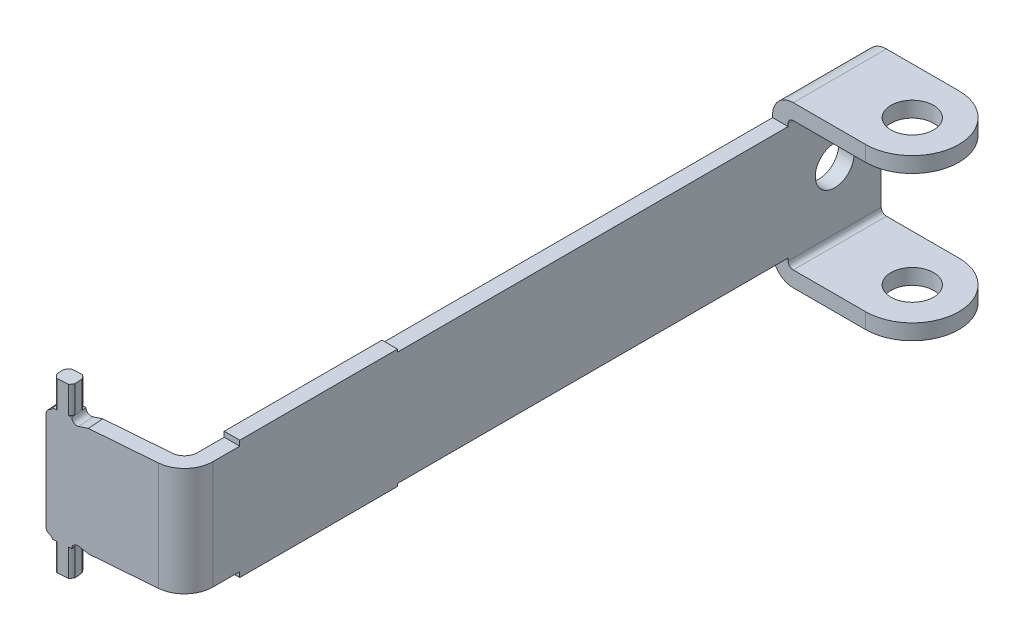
ISO-10303-21;
HEADER;
FILE_DESCRIPTION(('STEP AP214'),'2;1');
FILE_NAME('part.step','',(''),(''),'','','');
FILE_SCHEMA(('AUTOMOTIVE_DESIGN { 1 0 10303 214 1 1 1 1 }'));
ENDSEC;
DATA;
#1=APPLICATION_CONTEXT('core data for automotive mechanical design processes');
#2=APPLICATION_PROTOCOL_DEFINITION('international standard','automotive_design',2000,#1);
#3=PRODUCT_CONTEXT('',#1,'mechanical');
#4=PRODUCT('Part','Part','',(#3));
#5=PRODUCT_RELATED_PRODUCT_CATEGORY('part','',(#4));
#6=PRODUCT_DEFINITION_FORMATION('','',#4);
#7=PRODUCT_DEFINITION_CONTEXT('part definition',#1,'design');
#8=PRODUCT_DEFINITION('design','',#6,#7);
#9=PRODUCT_DEFINITION_SHAPE('','',#8);
#10=(LENGTH_UNIT() NAMED_UNIT(*) SI_UNIT(.MILLI.,.METRE.));
#11=(NAMED_UNIT(*) PLANE_ANGLE_UNIT() SI_UNIT($,.RADIAN.));
#12=(NAMED_UNIT(*) SI_UNIT($,.STERADIAN.) SOLID_ANGLE_UNIT());
#13=UNCERTAINTY_MEASURE_WITH_UNIT(LENGTH_MEASURE(1.E-05),#10,'distance_accuracy_value','');
#14=(GEOMETRIC_REPRESENTATION_CONTEXT(3) GLOBAL_UNCERTAINTY_ASSIGNED_CONTEXT((#13)) GLOBAL_UNIT_ASSIGNED_CONTEXT((#10,
#11,#12)) REPRESENTATION_CONTEXT('',''));
#15=CARTESIAN_POINT('',(0.,0.,0.));
#16=DIRECTION('',(0.,0.,1.));
#17=DIRECTION('',(1.,0.,0.));
#18=AXIS2_PLACEMENT_3D('',#15,#16,#17);
#19=CARTESIAN_POINT('',(3.8,7.2325,-8.1));
#20=DIRECTION('',(0.,1.,0.));
#21=DIRECTION('',(0.,0.,1.));
#22=AXIS2_PLACEMENT_3D('',#19,#20,#21);
#23=PLANE('',#22);
#24=CARTESIAN_POINT('',(0.42309866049,7.2325,-8.993953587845));
#25=DIRECTION('',(0.,-1.,0.));
#26=DIRECTION('',(0.,0.,-1.));
#27=AXIS2_PLACEMENT_3D('',#24,#25,#26);
#28=CIRCLE('',#27,0.359734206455);
#29=CARTESIAN_POINT('',(0.0800934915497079,7.2325,-8.88552779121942));
#30=VERTEX_POINT('',#29);
#31=CARTESIAN_POINT('',(0.24873210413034,7.2325,-8.67930298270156));
#32=VERTEX_POINT('',#31);
#33=EDGE_CURVE('E21',#30,#32,#28,.F.);
#34=ORIENTED_EDGE('',*,*,#33,.F.);
#35=DIRECTION('',(-0.0784590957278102,0.,-0.996917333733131));
#36=VECTOR('',#35,1.);
#37=CARTESIAN_POINT('',(0.0737242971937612,7.23249993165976,-8.96645722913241));
#38=LINE('',#37,#36);
#39=CARTESIAN_POINT('',(0.0972620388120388,7.23249996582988,-8.6673820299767));
#40=VERTEX_POINT('',#39);
#41=EDGE_CURVE('E370',#30,#40,#38,.F.);
#42=ORIENTED_EDGE('',*,*,#41,.T.);
#43=DIRECTION('',(0.996917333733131,0.,-0.0784590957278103));
#44=VECTOR('',#43,1.);
#45=CARTESIAN_POINT('',(-0.13905254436,7.2325,-8.648783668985));
#46=LINE('',#45,#44);
#47=EDGE_CURVE('E372',#32,#40,#46,.F.);
#48=ORIENTED_EDGE('',*,*,#47,.F.);
#49=EDGE_LOOP('',(#34,#42,#48));
#50=FACE_BOUND('',#49,.T.);
#51=ADVANCED_FACE('F18',(#50),#23,.T.);
#52=CARTESIAN_POINT('',(0.11017678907,7.1325,-8.668398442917));
#53=DIRECTION('',(-0.996917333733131,0.,0.0784590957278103));
#54=DIRECTION('',(0.0784590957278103,0.,0.996917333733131));
#55=AXIS2_PLACEMENT_3D('',#52,#53,#54);
#56=PLANE('',#55);
#57=DIRECTION('',(0.,-1.,0.));
#58=VECTOR('',#57,1.);
#59=CARTESIAN_POINT('',(0.0964079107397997,7.7575,-8.84334863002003));
#60=LINE('',#59,#58);
#61=CARTESIAN_POINT('',(0.0964079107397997,8.2825,-8.84334863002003));
#62=VERTEX_POINT('',#61);
#63=CARTESIAN_POINT('',(0.0964079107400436,7.30330992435,-8.8433486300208));
#64=VERTEX_POINT('',#63);
#65=EDGE_CURVE('E375',#62,#64,#60,.T.);
#66=ORIENTED_EDGE('',*,*,#65,.F.);
#67=DIRECTION('',(0.078459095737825,0.,0.996917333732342));
#68=VECTOR('',#67,1.);
#69=CARTESIAN_POINT('',(0.0777869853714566,8.2825,-9.07994992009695));
#70=LINE('',#69,#68);
#71=CARTESIAN_POINT('',(0.0777869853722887,8.2825,-9.07994992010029));
#72=VERTEX_POINT('',#71);
#73=EDGE_CURVE('E995',#72,#62,#70,.T.);
#74=ORIENTED_EDGE('',*,*,#73,.F.);
#75=DIRECTION('',(0.,-1.,0.));
#76=VECTOR('',#75,1.);
#77=CARTESIAN_POINT('',(0.0777869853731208,7.7575,-9.07994992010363));
#78=LINE('',#77,#76);
#79=CARTESIAN_POINT('',(0.0777869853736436,7.30330992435,-9.07994992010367));
#80=VERTEX_POINT('',#79);
#81=EDGE_CURVE('E735',#80,#72,#78,.F.);
#82=ORIENTED_EDGE('',*,*,#81,.F.);
#83=DIRECTION('',(-0.0784590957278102,0.,-0.996917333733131));
#84=VECTOR('',#83,1.);
#85=CARTESIAN_POINT('',(0.0866390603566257,7.30330992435,-8.96747364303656));
#86=LINE('',#85,#84);
#87=EDGE_CURVE('E382',#80,#64,#86,.F.);
#88=ORIENTED_EDGE('',*,*,#87,.T.);
#89=EDGE_LOOP('',(#66,#74,#82,#88));
#90=FACE_BOUND('',#89,.T.);
#91=ADVANCED_FACE('F755',(#90),#56,.T.);
#92=CARTESIAN_POINT('',(0.42309866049,7.7575,-8.993953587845));
#93=DIRECTION('',(0.,-1.,0.));
#94=DIRECTION('',(0.,0.,-1.));
#95=AXIS2_PLACEMENT_3D('',#92,#93,#94);
#96=CYLINDRICAL_SURFACE('',#95,0.359734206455);
#97=CARTESIAN_POINT('',(0.42309866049,8.2825,-8.993953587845));
#98=DIRECTION('',(0.,-1.,0.));
#99=DIRECTION('',(0.,0.,-1.));
#100=AXIS2_PLACEMENT_3D('',#97,#98,#99);
#101=CIRCLE('',#100,0.359734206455);
#102=CARTESIAN_POINT('',(0.24873210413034,8.2825,-8.67930298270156));
#103=VERTEX_POINT('',#102);
#104=EDGE_CURVE('E994',#62,#103,#101,.F.);
#105=ORIENTED_EDGE('',*,*,#104,.F.);
#106=ORIENTED_EDGE('',*,*,#65,.T.);
#107=CARTESIAN_POINT('',(0.0964079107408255,7.30330992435,-8.8433486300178));
#108=CARTESIAN_POINT('',(0.0964159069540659,7.29860690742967,-8.84333906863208));
#109=CARTESIAN_POINT('',(0.0962076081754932,7.29391604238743,-8.84378289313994));
#110=CARTESIAN_POINT('',(0.0954266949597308,7.2847813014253,-8.8454906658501));
#111=CARTESIAN_POINT('',(0.0948590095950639,7.28033495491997,-8.84674352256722));
#112=CARTESIAN_POINT('',(0.0934260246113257,7.27178683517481,-8.84998291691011));
#113=CARTESIAN_POINT('',(0.0925614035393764,7.2676843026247,-8.85196778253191));
#114=CARTESIAN_POINT('',(0.0906206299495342,7.25987891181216,-8.85657309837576));
#115=CARTESIAN_POINT('',(0.089543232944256,7.25617861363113,-8.85919731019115));
#116=CARTESIAN_POINT('',(0.0870918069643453,7.24869720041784,-8.86542041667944));
#117=CARTESIAN_POINT('',(0.085697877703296,7.24499740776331,-8.86910802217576));
#118=CARTESIAN_POINT('',(0.0828868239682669,7.23826460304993,-8.87698119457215));
#119=CARTESIAN_POINT('',(0.0814700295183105,7.23522578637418,-8.88116188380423));
#120=CARTESIAN_POINT('',(0.0800934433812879,7.23249959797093,-8.88552794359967));
#121=B_SPLINE_CURVE_WITH_KNOTS('',3,(#107,#108,#109,#110,#111,#112,#113,#114,#115,#116,#117,
#118,#119,#120),.UNSPECIFIED.,.F.,.F.,(4,2,2,2,2,2,4),(0.,0.0140643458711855,0.0279398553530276,
0.0417838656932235,0.0557113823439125,0.0718613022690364,0.0878630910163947),.UNSPECIFIED.);
#122=EDGE_CURVE('E378',#64,#30,#121,.T.);
#123=ORIENTED_EDGE('',*,*,#122,.T.);
#124=ORIENTED_EDGE('',*,*,#33,.T.);
#125=DIRECTION('',(0.,1.,0.));
#126=VECTOR('',#125,1.);
#127=CARTESIAN_POINT('',(0.248732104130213,5.0325,-8.67930298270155));
#128=LINE('',#127,#126);
#129=EDGE_CURVE('E407',#103,#32,#128,.F.);
#130=ORIENTED_EDGE('',*,*,#129,.F.);
#131=EDGE_LOOP('',(#105,#106,#123,#124,#130));
#132=FACE_BOUND('',#131,.T.);
#133=ADVANCED_FACE('F380',(#132),#96,.T.);
#134=CARTESIAN_POINT('',(0.42309866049,7.7575,-8.993953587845));
#135=DIRECTION('',(0.,-1.,0.));
#136=DIRECTION('',(0.,0.,-1.));
#137=AXIS2_PLACEMENT_3D('',#134,#135,#136);
#138=CYLINDRICAL_SURFACE('',#137,0.372359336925);
#139=DIRECTION('',(0.,1.,0.));
#140=VECTOR('',#139,1.);
#141=CARTESIAN_POINT('',(0.771900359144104,8.2825,-8.86361230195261));
#142=LINE('',#141,#140);
#143=CARTESIAN_POINT('',(0.771900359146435,8.2825,-8.8636123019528));
#144=VERTEX_POINT('',#143);
#145=CARTESIAN_POINT('',(0.771900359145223,7.2325,-8.86361230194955));
#146=VERTEX_POINT('',#145);
#147=EDGE_CURVE('E543',#144,#146,#142,.F.);
#148=ORIENTED_EDGE('',*,*,#147,.F.);
#149=CARTESIAN_POINT('',(0.42309866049,8.2825,-8.993953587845));
#150=DIRECTION('',(0.,-1.,0.));
#151=DIRECTION('',(0.,0.,-1.));
#152=AXIS2_PLACEMENT_3D('',#149,#150,#151);
#153=CIRCLE('',#152,0.372359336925);
#154=CARTESIAN_POINT('',(0.666527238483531,8.2825,-8.71218417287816));
#155=VERTEX_POINT('',#154);
#156=EDGE_CURVE('E990',#155,#144,#153,.F.);
#157=ORIENTED_EDGE('',*,*,#156,.F.);
#158=DIRECTION('',(0.,1.,0.));
#159=VECTOR('',#158,1.);
#160=CARTESIAN_POINT('',(0.666527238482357,5.0325,-8.71218417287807));
#161=LINE('',#160,#159);
#162=CARTESIAN_POINT('',(0.66652723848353,7.2325,-8.71218417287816));
#163=VERTEX_POINT('',#162);
#164=EDGE_CURVE('E395',#163,#155,#161,.T.);
#165=ORIENTED_EDGE('',*,*,#164,.F.);
#166=CARTESIAN_POINT('',(0.42309866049,7.2325,-8.993953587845));
#167=DIRECTION('',(0.,-1.,0.));
#168=DIRECTION('',(0.,0.,-1.));
#169=AXIS2_PLACEMENT_3D('',#166,#167,#168);
#170=CIRCLE('',#169,0.372359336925);
#171=EDGE_CURVE('E546',#146,#163,#170,.T.);
#172=ORIENTED_EDGE('',*,*,#171,.F.);
#173=EDGE_LOOP('',(#148,#157,#165,#172));
#174=FACE_BOUND('',#173,.T.);
#175=ADVANCED_FACE('F754',(#174),#138,.T.);
#176=CARTESIAN_POINT('',(3.8,7.2325,-8.1));
#177=DIRECTION('',(0.,1.,0.));
#178=DIRECTION('',(0.,0.,1.));
#179=AXIS2_PLACEMENT_3D('',#176,#177,#178);
#180=PLANE('',#179);
#181=DIRECTION('',(-0.07845909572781,0.,-0.996917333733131));
#182=VECTOR('',#181,1.);
#183=CARTESIAN_POINT('',(0.759558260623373,7.2325,-9.02043353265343));
#184=LINE('',#183,#182);
#185=CARTESIAN_POINT('',(0.783095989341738,7.2325,-8.72135833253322));
#186=VERTEX_POINT('',#185);
#187=EDGE_CURVE('E542',#186,#146,#184,.T.);
#188=ORIENTED_EDGE('',*,*,#187,.T.);
#189=ORIENTED_EDGE('',*,*,#171,.T.);
#190=DIRECTION('',(0.996917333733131,0.,-0.0784590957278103));
#191=VECTOR('',#190,1.);
#192=CARTESIAN_POINT('',(-0.13905254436,7.2325,-8.648783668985));
#193=LINE('',#192,#191);
#194=EDGE_CURVE('E396',#186,#163,#193,.F.);
#195=ORIENTED_EDGE('',*,*,#194,.F.);
#196=EDGE_LOOP('',(#188,#189,#195));
#197=FACE_BOUND('',#196,.T.);
#198=ADVANCED_FACE('F1265',(#197),#180,.T.);
#199=CARTESIAN_POINT('',(0.78309598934,8.2825,-8.721358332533));
#200=DIRECTION('',(0.996917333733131,0.,-0.0784590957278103));
#201=DIRECTION('',(-0.0784590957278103,0.,-0.996917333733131));
#202=AXIS2_PLACEMENT_3D('',#199,#200,#201);
#203=PLANE('',#202);
#204=ORIENTED_EDGE('',*,*,#147,.T.);
#205=DIRECTION('',(-0.07845909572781,0.,-0.996917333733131));
#206=VECTOR('',#205,1.);
#207=CARTESIAN_POINT('',(0.759558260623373,7.2325,-9.02043353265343));
#208=LINE('',#207,#206);
#209=CARTESIAN_POINT('',(0.749009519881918,7.2325,-9.15446799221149));
#210=VERTEX_POINT('',#209);
#211=EDGE_CURVE('E538',#146,#210,#208,.T.);
#212=ORIENTED_EDGE('',*,*,#211,.T.);
#213=DIRECTION('',(0.,-1.,0.));
#214=VECTOR('',#213,1.);
#215=CARTESIAN_POINT('',(0.749009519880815,7.7575,-9.15446799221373));
#216=LINE('',#215,#214);
#217=CARTESIAN_POINT('',(0.749009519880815,8.2825,-9.15446799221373));
#218=VERTEX_POINT('',#217);
#219=EDGE_CURVE('E550',#218,#210,#216,.T.);
#220=ORIENTED_EDGE('',*,*,#219,.F.);
#221=DIRECTION('',(-0.0784590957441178,0.,-0.996917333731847));
#222=VECTOR('',#221,1.);
#223=CARTESIAN_POINT('',(0.771900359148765,8.2825,-8.86361230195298));
#224=LINE('',#223,#222);
#225=EDGE_CURVE('E553',#144,#218,#224,.T.);
#226=ORIENTED_EDGE('',*,*,#225,.F.);
#227=EDGE_LOOP('',(#204,#212,#220,#226));
#228=FACE_BOUND('',#227,.T.);
#229=ADVANCED_FACE('F1263',(#228),#203,.T.);
#230=CARTESIAN_POINT('',(3.8,2.8325,-8.1));
#231=DIRECTION('',(0.,1.,0.));
#232=DIRECTION('',(0.,0.,1.));
#233=AXIS2_PLACEMENT_3D('',#230,#231,#232);
#234=PLANE('',#233);
#235=CARTESIAN_POINT('',(0.42309866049,2.8325,-8.993953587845));
#236=DIRECTION('',(0.,-1.,0.));
#237=DIRECTION('',(0.,0.,-1.));
#238=AXIS2_PLACEMENT_3D('',#235,#236,#237);
#239=CIRCLE('',#238,0.372359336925);
#240=CARTESIAN_POINT('',(0.771900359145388,2.8325,-8.86361230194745));
#241=VERTEX_POINT('',#240);
#242=CARTESIAN_POINT('',(0.66652723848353,2.8325,-8.71218417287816));
#243=VERTEX_POINT('',#242);
#244=EDGE_CURVE('E475',#241,#243,#239,.T.);
#245=ORIENTED_EDGE('',*,*,#244,.F.);
#246=DIRECTION('',(0.07845909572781,0.,0.996917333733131));
#247=VECTOR('',#246,1.);
#248=CARTESIAN_POINT('',(0.759558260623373,2.8325,-9.02043353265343));
#249=LINE('',#248,#247);
#250=CARTESIAN_POINT('',(0.783095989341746,2.8325,-8.72135833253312));
#251=VERTEX_POINT('',#250);
#252=EDGE_CURVE('E483',#241,#251,#249,.T.);
#253=ORIENTED_EDGE('',*,*,#252,.T.);
#254=DIRECTION('',(0.996917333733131,0.,-0.0784590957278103));
#255=VECTOR('',#254,1.);
#256=CARTESIAN_POINT('',(-0.13905254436,2.8325,-8.648783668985));
#257=LINE('',#256,#255);
#258=EDGE_CURVE('E399',#243,#251,#257,.T.);
#259=ORIENTED_EDGE('',*,*,#258,.F.);
#260=EDGE_LOOP('',(#245,#253,#259));
#261=FACE_BOUND('',#260,.T.);
#262=ADVANCED_FACE('F1242',(#261),#234,.F.);
#263=CARTESIAN_POINT('',(0.42309866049,7.7575,-8.993953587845));
#264=DIRECTION('',(0.,-1.,0.));
#265=DIRECTION('',(0.,0.,-1.));
#266=AXIS2_PLACEMENT_3D('',#263,#264,#265);
#267=CYLINDRICAL_SURFACE('',#266,0.372359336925);
#268=ORIENTED_EDGE('',*,*,#244,.T.);
#269=DIRECTION('',(0.,1.,0.));
#270=VECTOR('',#269,1.);
#271=CARTESIAN_POINT('',(0.666527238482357,5.0325,-8.71218417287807));
#272=LINE('',#271,#270);
#273=CARTESIAN_POINT('',(0.666527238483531,1.7825,-8.71218417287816));
#274=VERTEX_POINT('',#273);
#275=EDGE_CURVE('E401',#274,#243,#272,.T.);
#276=ORIENTED_EDGE('',*,*,#275,.F.);
#277=CARTESIAN_POINT('',(0.42309866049,1.7825,-8.993953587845));
#278=DIRECTION('',(0.,-1.,0.));
#279=DIRECTION('',(0.,0.,-1.));
#280=AXIS2_PLACEMENT_3D('',#277,#278,#279);
#281=CIRCLE('',#280,0.372359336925);
#282=CARTESIAN_POINT('',(0.7719003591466,1.7825,-8.8636123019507));
#283=VERTEX_POINT('',#282);
#284=EDGE_CURVE('E923',#274,#283,#281,.F.);
#285=ORIENTED_EDGE('',*,*,#284,.T.);
#286=DIRECTION('',(0.,1.,0.));
#287=VECTOR('',#286,1.);
#288=CARTESIAN_POINT('',(0.771900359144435,8.2825,-8.86361230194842));
#289=LINE('',#288,#287);
#290=EDGE_CURVE('E467',#241,#283,#289,.F.);
#291=ORIENTED_EDGE('',*,*,#290,.F.);
#292=EDGE_LOOP('',(#268,#276,#285,#291));
#293=FACE_BOUND('',#292,.T.);
#294=ADVANCED_FACE('F1245',(#293),#267,.T.);
#295=CARTESIAN_POINT('',(0.78309598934,8.2825,-8.721358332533));
#296=DIRECTION('',(0.996917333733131,0.,-0.0784590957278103));
#297=DIRECTION('',(-0.0784590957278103,0.,-0.996917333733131));
#298=AXIS2_PLACEMENT_3D('',#295,#296,#297);
#299=PLANE('',#298);
#300=DIRECTION('',(-0.0784590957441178,0.,-0.996917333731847));
#301=VECTOR('',#300,1.);
#302=CARTESIAN_POINT('',(0.771900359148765,1.7825,-8.86361230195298));
#303=LINE('',#302,#301);
#304=CARTESIAN_POINT('',(0.749009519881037,1.7825,-9.15446799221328));
#305=VERTEX_POINT('',#304);
#306=EDGE_CURVE('E920',#283,#305,#303,.T.);
#307=ORIENTED_EDGE('',*,*,#306,.T.);
#308=DIRECTION('',(0.,-1.,0.));
#309=VECTOR('',#308,1.);
#310=CARTESIAN_POINT('',(0.749009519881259,7.7575,-9.15446799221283));
#311=LINE('',#310,#309);
#312=CARTESIAN_POINT('',(0.749009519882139,2.8325,-9.15446799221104));
#313=VERTEX_POINT('',#312);
#314=EDGE_CURVE('E468',#313,#305,#311,.T.);
#315=ORIENTED_EDGE('',*,*,#314,.F.);
#316=DIRECTION('',(0.07845909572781,0.,0.996917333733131));
#317=VECTOR('',#316,1.);
#318=CARTESIAN_POINT('',(0.759558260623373,2.8325,-9.02043353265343));
#319=LINE('',#318,#317);
#320=EDGE_CURVE('E480',#313,#241,#319,.T.);
#321=ORIENTED_EDGE('',*,*,#320,.T.);
#322=ORIENTED_EDGE('',*,*,#290,.T.);
#323=EDGE_LOOP('',(#307,#315,#321,#322));
#324=FACE_BOUND('',#323,.T.);
#325=ADVANCED_FACE('F1248',(#324),#299,.T.);
#326=CARTESIAN_POINT('',(0.42309866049,7.7575,-8.993953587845));
#327=DIRECTION('',(0.,-1.,0.));
#328=DIRECTION('',(0.,0.,-1.));
#329=AXIS2_PLACEMENT_3D('',#326,#327,#328);
#330=CYLINDRICAL_SURFACE('',#329,0.359734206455);
#331=CARTESIAN_POINT('',(0.0800934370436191,2.83250036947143,-8.88552789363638));
#332=CARTESIAN_POINT('',(0.0813457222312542,2.83002077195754,-8.88155893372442));
#333=CARTESIAN_POINT('',(0.0826293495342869,2.8272862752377,-8.87774534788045));
#334=CARTESIAN_POINT('',(0.0851859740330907,2.82127820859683,-8.87051071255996));
#335=CARTESIAN_POINT('',(0.0864587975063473,2.81800039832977,-8.86709314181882));
#336=CARTESIAN_POINT('',(0.0889027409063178,2.81090077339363,-8.8607868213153));
#337=CARTESIAN_POINT('',(0.0900733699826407,2.80707654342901,-8.85790055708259));
#338=CARTESIAN_POINT('',(0.0921942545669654,2.79894831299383,-8.85282048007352));
#339=CARTESIAN_POINT('',(0.0931451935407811,2.7946458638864,-8.85062451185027));
#340=CARTESIAN_POINT('',(0.0945807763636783,2.78647040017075,-8.84736819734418));
#341=CARTESIAN_POINT('',(0.0951185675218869,2.78265970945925,-8.84617451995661));
#342=CARTESIAN_POINT('',(0.0959273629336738,2.77487523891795,-8.84439202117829));
#343=CARTESIAN_POINT('',(0.0961988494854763,2.77090176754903,-8.84380210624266));
#344=CARTESIAN_POINT('',(0.0963806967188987,2.76516974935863,-8.8434078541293));
#345=CARTESIAN_POINT('',(0.0964084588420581,2.76342948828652,-8.84334791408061));
#346=CARTESIAN_POINT('',(0.0964079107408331,2.76169007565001,-8.84334863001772));
#347=B_SPLINE_CURVE_WITH_KNOTS('',3,(#331,#332,#333,#334,#335,#336,#337,#338,#339,#340,#341,
#342,#343,#344,#345,#346),.UNSPECIFIED.,.F.,.F.,(4,2,2,2,2,2,2,4),(0.,0.0145418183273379,
0.0292029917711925,0.0439310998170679,0.0586127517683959,0.0706487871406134,0.0826629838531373,
0.0878823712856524),.UNSPECIFIED.);
#348=CARTESIAN_POINT('',(0.0800935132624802,2.8325,-8.88552772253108));
#349=VERTEX_POINT('',#348);
#350=CARTESIAN_POINT('',(0.0964079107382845,2.76169007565,-8.84334863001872));
#351=VERTEX_POINT('',#350);
#352=EDGE_CURVE('E2543',#349,#351,#347,.T.);
#353=ORIENTED_EDGE('',*,*,#352,.T.);
#354=DIRECTION('',(0.,1.,0.));
#355=VECTOR('',#354,1.);
#356=CARTESIAN_POINT('',(0.0964079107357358,7.1325,-8.84334863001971));
#357=LINE('',#356,#355);
#358=CARTESIAN_POINT('',(0.0964079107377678,1.7825,-8.84334863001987));
#359=VERTEX_POINT('',#358);
#360=EDGE_CURVE('E463',#359,#351,#357,.T.);
#361=ORIENTED_EDGE('',*,*,#360,.F.);
#362=CARTESIAN_POINT('',(0.42309866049,1.7825,-8.993953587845));
#363=DIRECTION('',(0.,-1.,0.));
#364=DIRECTION('',(0.,0.,-1.));
#365=AXIS2_PLACEMENT_3D('',#362,#363,#364);
#366=CIRCLE('',#365,0.359734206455);
#367=CARTESIAN_POINT('',(0.24873210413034,1.7825,-8.67930298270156));
#368=VERTEX_POINT('',#367);
#369=EDGE_CURVE('E927',#359,#368,#366,.F.);
#370=ORIENTED_EDGE('',*,*,#369,.T.);
#371=DIRECTION('',(0.,1.,0.));
#372=VECTOR('',#371,1.);
#373=CARTESIAN_POINT('',(0.248732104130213,5.0325,-8.67930298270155));
#374=LINE('',#373,#372);
#375=CARTESIAN_POINT('',(0.24873210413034,2.83250001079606,-8.67930298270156));
#376=VERTEX_POINT('',#375);
#377=EDGE_CURVE('E405',#376,#368,#374,.F.);
#378=ORIENTED_EDGE('',*,*,#377,.F.);
#379=CARTESIAN_POINT('',(0.42309866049,2.8325,-8.993953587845));
#380=DIRECTION('',(0.,-1.,0.));
#381=DIRECTION('',(0.,0.,-1.));
#382=AXIS2_PLACEMENT_3D('',#379,#380,#381);
#383=CIRCLE('',#382,0.359734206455);
#384=EDGE_CURVE('E466',#376,#349,#383,.T.);
#385=ORIENTED_EDGE('',*,*,#384,.T.);
#386=EDGE_LOOP('',(#353,#361,#370,#378,#385));
#387=FACE_BOUND('',#386,.T.);
#388=ADVANCED_FACE('F1236',(#387),#330,.T.);
#389=CARTESIAN_POINT('',(0.11017678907,7.1325,-8.668398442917));
#390=DIRECTION('',(-0.996917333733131,0.,0.0784590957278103));
#391=DIRECTION('',(0.0784590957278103,0.,0.996917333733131));
#392=AXIS2_PLACEMENT_3D('',#389,#390,#391);
#393=PLANE('',#392);
#394=DIRECTION('',(0.0784590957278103,0.,0.996917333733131));
#395=VECTOR('',#394,1.);
#396=CARTESIAN_POINT('',(0.11017678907,2.76169007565,-8.668398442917));
#397=LINE('',#396,#395);
#398=CARTESIAN_POINT('',(0.0777869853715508,2.76169007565,-9.07994992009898));
#399=VERTEX_POINT('',#398);
#400=EDGE_CURVE('E660',#351,#399,#397,.F.);
#401=ORIENTED_EDGE('',*,*,#400,.T.);
#402=DIRECTION('',(0.,-1.,0.));
#403=VECTOR('',#402,1.);
#404=CARTESIAN_POINT('',(0.0777869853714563,7.7575,-9.07994992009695));
#405=LINE('',#404,#403);
#406=CARTESIAN_POINT('',(0.0777869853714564,1.7825,-9.07994992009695));
#407=VERTEX_POINT('',#406);
#408=EDGE_CURVE('E912',#407,#399,#405,.F.);
#409=ORIENTED_EDGE('',*,*,#408,.F.);
#410=DIRECTION('',(0.078459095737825,0.,0.996917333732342));
#411=VECTOR('',#410,1.);
#412=CARTESIAN_POINT('',(0.0777869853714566,1.7825,-9.07994992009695));
#413=LINE('',#412,#411);
#414=EDGE_CURVE('E471',#407,#359,#413,.T.);
#415=ORIENTED_EDGE('',*,*,#414,.T.);
#416=ORIENTED_EDGE('',*,*,#360,.T.);
#417=EDGE_LOOP('',(#401,#409,#415,#416));
#418=FACE_BOUND('',#417,.T.);
#419=ADVANCED_FACE('F1255',(#418),#393,.T.);
#420=CARTESIAN_POINT('',(3.8,2.8325,-8.1));
#421=DIRECTION('',(0.,1.,0.));
#422=DIRECTION('',(0.,0.,1.));
#423=AXIS2_PLACEMENT_3D('',#420,#421,#422);
#424=PLANE('',#423);
#425=DIRECTION('',(0.07845909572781,0.,0.996917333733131));
#426=VECTOR('',#425,1.);
#427=CARTESIAN_POINT('',(0.0737243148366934,2.83250002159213,-8.96645723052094));
#428=LINE('',#427,#426);
#429=CARTESIAN_POINT('',(0.097262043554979,2.83250002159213,-8.66738203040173));
#430=VERTEX_POINT('',#429);
#431=EDGE_CURVE('E651',#430,#349,#428,.F.);
#432=ORIENTED_EDGE('',*,*,#431,.T.);
#433=ORIENTED_EDGE('',*,*,#384,.F.);
#434=DIRECTION('',(0.996917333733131,0.,-0.0784590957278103));
#435=VECTOR('',#434,1.);
#436=CARTESIAN_POINT('',(-0.13905254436,2.83250002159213,-8.648783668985));
#437=LINE('',#436,#435);
#438=EDGE_CURVE('E402',#430,#376,#437,.T.);
#439=ORIENTED_EDGE('',*,*,#438,.F.);
#440=EDGE_LOOP('',(#432,#433,#439));
#441=FACE_BOUND('',#440,.T.);
#442=ADVANCED_FACE('F1234',(#441),#424,.F.);
#443=CARTESIAN_POINT('',(-0.13905254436,5.0325,-8.648783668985));
#444=DIRECTION('',(0.0784590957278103,0.,0.996917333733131));
#445=DIRECTION('',(0.996917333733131,0.,-0.0784590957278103));
#446=AXIS2_PLACEMENT_3D('',#443,#444,#445);
#447=PLANE('',#446);
#448=ORIENTED_EDGE('',*,*,#194,.T.);
#449=ORIENTED_EDGE('',*,*,#164,.T.);
#450=DIRECTION('',(0.996917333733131,0.,-0.0784590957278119));
#451=VECTOR('',#450,1.);
#452=CARTESIAN_POINT('',(0.248732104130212,8.2825,-8.67930298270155));
#453=LINE('',#452,#451);
#454=EDGE_CURVE('E991',#103,#155,#453,.T.);
#455=ORIENTED_EDGE('',*,*,#454,.F.);
#456=ORIENTED_EDGE('',*,*,#129,.T.);
#457=ORIENTED_EDGE('',*,*,#47,.T.);
#458=CARTESIAN_POINT('',(-0.0892066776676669,7.30330992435,-8.65270662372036));
#459=DIRECTION('',(-0.0784590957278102,0.,-0.996917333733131));
#460=DIRECTION('',(-0.996917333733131,0.,0.0784590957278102));
#461=AXIS2_PLACEMENT_3D('',#458,#459,#460);
#462=CIRCLE('',#461,0.2);
#463=CARTESIAN_POINT('',(-0.0144378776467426,7.11790496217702,-8.65859105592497));
#464=VERTEX_POINT('',#463);
#465=EDGE_CURVE('E387',#40,#464,#462,.T.);
#466=ORIENTED_EDGE('',*,*,#465,.T.);
#467=CARTESIAN_POINT('',(0.0603309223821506,6.9325,-8.66447548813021));
#468=DIRECTION('',(-0.0784590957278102,0.,-0.996917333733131));
#469=DIRECTION('',(-0.996917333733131,0.,0.0784590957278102));
#470=AXIS2_PLACEMENT_3D('',#467,#468,#469);
#471=CIRCLE('',#470,0.2);
#472=CARTESIAN_POINT('',(-0.139052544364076,6.9325,-8.64878366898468));
#473=VERTEX_POINT('',#472);
#474=EDGE_CURVE('E641',#473,#464,#471,.T.);
#475=ORIENTED_EDGE('',*,*,#474,.F.);
#476=DIRECTION('',(0.,1.,0.));
#477=VECTOR('',#476,1.);
#478=CARTESIAN_POINT('',(-0.139052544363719,5.0325,-8.64878366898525));
#479=LINE('',#478,#477);
#480=CARTESIAN_POINT('',(-0.139052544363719,3.1325,-8.64878366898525));
#481=VERTEX_POINT('',#480);
#482=EDGE_CURVE('E458',#481,#473,#479,.T.);
#483=ORIENTED_EDGE('',*,*,#482,.F.);
#484=CARTESIAN_POINT('',(0.0603309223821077,3.1325,-8.66447548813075));
#485=DIRECTION('',(0.07845909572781,0.,0.996917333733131));
#486=DIRECTION('',(0.996917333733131,0.,-0.07845909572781));
#487=AXIS2_PLACEMENT_3D('',#484,#485,#486);
#488=CIRCLE('',#487,0.2);
#489=CARTESIAN_POINT('',(-0.0144378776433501,2.94709503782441,-8.65859105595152));
#490=VERTEX_POINT('',#489);
#491=EDGE_CURVE('E462',#490,#481,#488,.F.);
#492=ORIENTED_EDGE('',*,*,#491,.F.);
#493=CARTESIAN_POINT('',(-0.0892066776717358,2.76169007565,-8.65270662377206));
#494=DIRECTION('',(0.07845909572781,0.,0.996917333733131));
#495=DIRECTION('',(0.996917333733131,0.,-0.07845909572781));
#496=AXIS2_PLACEMENT_3D('',#493,#494,#495);
#497=CIRCLE('',#496,0.2);
#498=EDGE_CURVE('E648',#490,#430,#497,.F.);
#499=ORIENTED_EDGE('',*,*,#498,.T.);
#500=ORIENTED_EDGE('',*,*,#438,.T.);
#501=ORIENTED_EDGE('',*,*,#377,.T.);
#502=DIRECTION('',(0.996917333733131,0.,-0.0784590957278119));
#503=VECTOR('',#502,1.);
#504=CARTESIAN_POINT('',(0.248732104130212,1.7825,-8.67930298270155));
#505=LINE('',#504,#503);
#506=EDGE_CURVE('E924',#368,#274,#505,.T.);
#507=ORIENTED_EDGE('',*,*,#506,.T.);
#508=ORIENTED_EDGE('',*,*,#275,.T.);
#509=ORIENTED_EDGE('',*,*,#258,.T.);
#510=CARTESIAN_POINT('',(0.982479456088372,2.8325,-8.73705015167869));
#511=DIRECTION('',(0.07845909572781,0.,0.996917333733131));
#512=DIRECTION('',(0.996917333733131,0.,-0.07845909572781));
#513=AXIS2_PLACEMENT_3D('',#510,#511,#512);
#514=CIRCLE('',#513,0.2);
#515=CARTESIAN_POINT('',(1.03408369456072,3.02568516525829,-8.74111149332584));
#516=VERTEX_POINT('',#515);
#517=EDGE_CURVE('E934',#251,#516,#514,.F.);
#518=ORIENTED_EDGE('',*,*,#517,.T.);
#519=DIRECTION('',(-0.962948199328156,0.258819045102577,0.0757856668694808));
#520=VECTOR('',#519,1.);
#521=CARTESIAN_POINT('',(1.38078340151,2.9325,-8.768397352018));
#522=LINE('',#521,#520);
#523=CARTESIAN_POINT('',(1.38078340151,2.9325,-8.768397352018));
#524=VERTEX_POINT('',#523);
#525=EDGE_CURVE('E488',#524,#516,#522,.T.);
#526=ORIENTED_EDGE('',*,*,#525,.F.);
#527=DIRECTION('',(-0.996917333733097,0.,0.0784590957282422));
#528=VECTOR('',#527,1.);
#529=CARTESIAN_POINT('',(3.88630500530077,2.9325,-8.96558617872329));
#530=LINE('',#529,#528);
#531=CARTESIAN_POINT('',(3.88630500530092,2.9325,-8.96558617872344));
#532=VERTEX_POINT('',#531);
#533=EDGE_CURVE('E950',#532,#524,#530,.T.);
#534=ORIENTED_EDGE('',*,*,#533,.F.);
#535=DIRECTION('',(0.,-1.,0.));
#536=VECTOR('',#535,1.);
#537=CARTESIAN_POINT('',(3.88630500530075,6.6575,-8.96558617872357));
#538=LINE('',#537,#536);
#539=CARTESIAN_POINT('',(3.8863050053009,7.1325,-8.96558617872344));
#540=VERTEX_POINT('',#539);
#541=EDGE_CURVE('E413',#540,#532,#538,.T.);
#542=ORIENTED_EDGE('',*,*,#541,.F.);
#543=DIRECTION('',(-0.9969173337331,0.,0.0784590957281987));
#544=VECTOR('',#543,1.);
#545=CARTESIAN_POINT('',(3.88630500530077,7.1325,-8.96558617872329));
#546=LINE('',#545,#544);
#547=CARTESIAN_POINT('',(1.38078340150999,7.1325,-8.76839735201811));
#548=VERTEX_POINT('',#547);
#549=EDGE_CURVE('E534',#540,#548,#546,.T.);
#550=ORIENTED_EDGE('',*,*,#549,.T.);
#551=DIRECTION('',(-0.96294819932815,-0.258819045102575,0.075785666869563));
#552=VECTOR('',#551,1.);
#553=CARTESIAN_POINT('',(1.38078340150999,7.1325,-8.76839735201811));
#554=LINE('',#553,#552);
#555=CARTESIAN_POINT('',(1.03408369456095,7.03931483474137,-8.74111149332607));
#556=VERTEX_POINT('',#555);
#557=EDGE_CURVE('E531',#548,#556,#554,.T.);
#558=ORIENTED_EDGE('',*,*,#557,.T.);
#559=CARTESIAN_POINT('',(0.982479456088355,7.2325,-8.7370501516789));
#560=DIRECTION('',(-0.07845909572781,0.,-0.996917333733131));
#561=DIRECTION('',(-0.996917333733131,0.,0.07845909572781));
#562=AXIS2_PLACEMENT_3D('',#559,#560,#561);
#563=CIRCLE('',#562,0.2);
#564=EDGE_CURVE('E549',#556,#186,#563,.T.);
#565=ORIENTED_EDGE('',*,*,#564,.T.);
#566=EDGE_LOOP('',(#448,#449,#455,#456,#457,#466,#475,#483,#492,#499,#500,#501,#507,#508,#509,
#518,#526,#534,#542,#550,#558,#565));
#567=FACE_BOUND('',#566,.T.);
#568=ADVANCED_FACE('F742',(#567),#447,.T.);
#569=CARTESIAN_POINT('',(-0.11274440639,7.30330992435,-8.951781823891));
#570=DIRECTION('',(-0.0784590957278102,0.,-0.996917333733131));
#571=DIRECTION('',(-0.996917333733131,0.,0.0784590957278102));
#572=AXIS2_PLACEMENT_3D('',#569,#570,#571);
#573=CYLINDRICAL_SURFACE('',#572,0.2);
#574=DIRECTION('',(0.0784559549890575,0.,0.996917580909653));
#575=VECTOR('',#574,1.);
#576=CARTESIAN_POINT('',(0.0501864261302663,7.2325,-9.26553241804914));
#577=LINE('',#576,#575);
#578=CARTESIAN_POINT('',(0.0501865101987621,7.2325,-9.26553242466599));
#579=VERTEX_POINT('',#578);
#580=CARTESIAN_POINT('',(0.0688764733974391,7.23249895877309,-9.02804411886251));
#581=VERTEX_POINT('',#580);
#582=EDGE_CURVE('E389',#579,#581,#577,.T.);
#583=ORIENTED_EDGE('',*,*,#582,.F.);
#584=CARTESIAN_POINT('',(-0.136282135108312,7.30330992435,-9.25085702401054));
#585=DIRECTION('',(-0.0784590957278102,0.,-0.996917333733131));
#586=DIRECTION('',(-0.996917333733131,0.,0.0784590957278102));
#587=AXIS2_PLACEMENT_3D('',#584,#585,#586);
#588=CIRCLE('',#587,0.2);
#589=CARTESIAN_POINT('',(-0.0615133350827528,7.11790496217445,-9.25674145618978));
#590=VERTEX_POINT('',#589);
#591=EDGE_CURVE('E416',#590,#579,#588,.F.);
#592=ORIENTED_EDGE('',*,*,#591,.F.);
#593=DIRECTION('',(-0.0784590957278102,0.,-0.996917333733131));
#594=VECTOR('',#593,1.);
#595=CARTESIAN_POINT('',(-0.0375124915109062,7.11790496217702,-8.95178182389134));
#596=LINE('',#595,#594);
#597=EDGE_CURVE('E644',#464,#590,#596,.T.);
#598=ORIENTED_EDGE('',*,*,#597,.F.);
#599=ORIENTED_EDGE('',*,*,#465,.F.);
#600=ORIENTED_EDGE('',*,*,#41,.F.);
#601=ORIENTED_EDGE('',*,*,#122,.F.);
#602=ORIENTED_EDGE('',*,*,#87,.F.);
#603=CARTESIAN_POINT('',(0.0688762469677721,7.23249796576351,-9.02804449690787));
#604=CARTESIAN_POINT('',(0.0692840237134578,7.23446044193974,-9.03230418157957));
#605=CARTESIAN_POINT('',(0.0697633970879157,7.23666986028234,-9.03645424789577));
#606=CARTESIAN_POINT('',(0.0708190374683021,7.24162554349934,-9.04445676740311));
#607=CARTESIAN_POINT('',(0.0713961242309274,7.24437638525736,-9.04830626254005));
#608=CARTESIAN_POINT('',(0.0725942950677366,7.25043621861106,-9.05556451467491));
#609=CARTESIAN_POINT('',(0.0732155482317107,7.25374743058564,-9.05897141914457));
#610=CARTESIAN_POINT('',(0.0744231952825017,7.26090161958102,-9.06516351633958));
#611=CARTESIAN_POINT('',(0.0750097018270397,7.26474272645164,-9.06795080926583));
#612=CARTESIAN_POINT('',(0.0759604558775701,7.27209517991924,-9.0722767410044));
#613=CARTESIAN_POINT('',(0.0763457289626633,7.27552273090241,-9.0739531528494));
#614=CARTESIAN_POINT('',(0.0769962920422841,7.28261692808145,-9.07672264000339));
#615=CARTESIAN_POINT('',(0.0772617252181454,7.28628328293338,-9.07781641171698));
#616=CARTESIAN_POINT('',(0.0775610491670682,7.292200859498,-9.07903879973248));
#617=CARTESIAN_POINT('',(0.0776453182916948,7.29440756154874,-9.07937959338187));
#618=CARTESIAN_POINT('',(0.0777584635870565,7.2988456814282,-9.07983542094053));
#619=CARTESIAN_POINT('',(0.077787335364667,7.30107710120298,-9.07995043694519));
#620=CARTESIAN_POINT('',(0.0777869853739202,7.30330992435,-9.07994992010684));
#621=B_SPLINE_CURVE_WITH_KNOTS('',3,(#603,#604,#605,#606,#607,#608,#609,#610,#611,#612,#613,
#614,#615,#616,#617,#618,#619,#620),.UNSPECIFIED.,.F.,.F.,(4,2,2,2,2,2,2,2,4),(0.,
0.0141303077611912,0.0283856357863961,0.0426988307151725,0.0569627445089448,0.0684204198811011,
0.0798643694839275,0.0865565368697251,0.0932492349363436),.UNSPECIFIED.);
#622=EDGE_CURVE('E728',#581,#80,#621,.T.);
#623=ORIENTED_EDGE('',*,*,#622,.F.);
#624=EDGE_LOOP('',(#583,#592,#598,#599,#600,#601,#602,#623));
#625=FACE_BOUND('',#624,.T.);
#626=ADVANCED_FACE('F385',(#625),#573,.F.);
#627=CARTESIAN_POINT('',(3.8,7.2325,-8.1));
#628=DIRECTION('',(0.,1.,0.));
#629=DIRECTION('',(0.,0.,1.));
#630=AXIS2_PLACEMENT_3D('',#627,#628,#629);
#631=PLANE('',#630);
#632=CARTESIAN_POINT('',(0.42309866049,7.2325,-8.993953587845));
#633=DIRECTION('',(0.,-1.,0.));
#634=DIRECTION('',(0.,0.,-1.));
#635=AXIS2_PLACEMENT_3D('',#632,#633,#634);
#636=CIRCLE('',#635,0.35585885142);
#637=CARTESIAN_POINT('',(0.208746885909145,7.2325,-9.27801139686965));
#638=VERTEX_POINT('',#637);
#639=EDGE_CURVE('E736',#638,#581,#636,.F.);
#640=ORIENTED_EDGE('',*,*,#639,.F.);
#641=DIRECTION('',(-0.996917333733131,0.,0.0784590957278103));
#642=VECTOR('',#641,1.);
#643=CARTESIAN_POINT('',(4.3,7.2325,-9.6));
#644=LINE('',#643,#642);
#645=EDGE_CURVE('E621',#579,#638,#644,.F.);
#646=ORIENTED_EDGE('',*,*,#645,.F.);
#647=ORIENTED_EDGE('',*,*,#582,.T.);
#648=EDGE_LOOP('',(#640,#646,#647));
#649=FACE_BOUND('',#648,.T.);
#650=ADVANCED_FACE('F724',(#649),#631,.T.);
#651=CARTESIAN_POINT('',(0.42309866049,7.7575,-8.993953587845));
#652=DIRECTION('',(0.,-1.,0.));
#653=DIRECTION('',(0.,0.,-1.));
#654=AXIS2_PLACEMENT_3D('',#651,#652,#653);
#655=CYLINDRICAL_SURFACE('',#654,0.35585885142);
#656=CARTESIAN_POINT('',(0.42309866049,8.2825,-8.993953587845));
#657=DIRECTION('',(0.,-1.,0.));
#658=DIRECTION('',(0.,0.,-1.));
#659=AXIS2_PLACEMENT_3D('',#656,#657,#658);
#660=CIRCLE('',#659,0.35585885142);
#661=CARTESIAN_POINT('',(0.208746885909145,8.2825,-9.27801139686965));
#662=VERTEX_POINT('',#661);
#663=EDGE_CURVE('E737',#662,#72,#660,.F.);
#664=ORIENTED_EDGE('',*,*,#663,.F.);
#665=DIRECTION('',(0.,1.,0.));
#666=VECTOR('',#665,1.);
#667=CARTESIAN_POINT('',(0.208746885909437,5.0325,-9.27801139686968));
#668=LINE('',#667,#666);
#669=EDGE_CURVE('E987',#638,#662,#668,.T.);
#670=ORIENTED_EDGE('',*,*,#669,.F.);
#671=ORIENTED_EDGE('',*,*,#639,.T.);
#672=ORIENTED_EDGE('',*,*,#622,.T.);
#673=ORIENTED_EDGE('',*,*,#81,.T.);
#674=EDGE_LOOP('',(#664,#670,#671,#672,#673));
#675=FACE_BOUND('',#674,.T.);
#676=ADVANCED_FACE('F719',(#675),#655,.T.);
#677=CARTESIAN_POINT('',(0.11017678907,8.2825,-8.668398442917));
#678=DIRECTION('',(0.,1.,0.));
#679=DIRECTION('',(0.,0.,1.));
#680=AXIS2_PLACEMENT_3D('',#677,#678,#679);
#681=PLANE('',#680);
#682=ORIENTED_EDGE('',*,*,#156,.T.);
#683=ORIENTED_EDGE('',*,*,#225,.T.);
#684=CARTESIAN_POINT('',(0.42309866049,8.2825,-8.993953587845));
#685=DIRECTION('',(0.,-1.,0.));
#686=DIRECTION('',(0.,0.,-1.));
#687=AXIS2_PLACEMENT_3D('',#684,#685,#686);
#688=CIRCLE('',#687,0.363294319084);
#689=CARTESIAN_POINT('',(0.603826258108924,8.2825,-9.30910481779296));
#690=VERTEX_POINT('',#689);
#691=EDGE_CURVE('E552',#690,#218,#688,.T.);
#692=ORIENTED_EDGE('',*,*,#691,.F.);
#693=DIRECTION('',(-0.996917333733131,0.,0.0784590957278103));
#694=VECTOR('',#693,1.);
#695=CARTESIAN_POINT('',(4.3,8.2825,-9.6));
#696=LINE('',#695,#694);
#697=EDGE_CURVE('E984',#662,#690,#696,.F.);
#698=ORIENTED_EDGE('',*,*,#697,.F.);
#699=ORIENTED_EDGE('',*,*,#663,.T.);
#700=ORIENTED_EDGE('',*,*,#73,.T.);
#701=ORIENTED_EDGE('',*,*,#104,.T.);
#702=ORIENTED_EDGE('',*,*,#454,.T.);
#703=EDGE_LOOP('',(#682,#683,#692,#698,#699,#700,#701,#702));
#704=FACE_BOUND('',#703,.T.);
#705=ADVANCED_FACE('F715',(#704),#681,.T.);
#706=CARTESIAN_POINT('',(0.42309866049,7.7575,-8.993953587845));
#707=DIRECTION('',(0.,-1.,0.));
#708=DIRECTION('',(0.,0.,-1.));
#709=AXIS2_PLACEMENT_3D('',#706,#707,#708);
#710=CYLINDRICAL_SURFACE('',#709,0.363294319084);
#711=DIRECTION('',(0.,1.,0.));
#712=VECTOR('',#711,1.);
#713=CARTESIAN_POINT('',(0.603826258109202,5.0325,-9.30910481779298));
#714=LINE('',#713,#712);
#715=CARTESIAN_POINT('',(0.603826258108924,7.2325,-9.30910481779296));
#716=VERTEX_POINT('',#715);
#717=EDGE_CURVE('E981',#690,#716,#714,.F.);
#718=ORIENTED_EDGE('',*,*,#717,.F.);
#719=ORIENTED_EDGE('',*,*,#691,.T.);
#720=ORIENTED_EDGE('',*,*,#219,.T.);
#721=CARTESIAN_POINT('',(0.42309866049,7.2325,-8.993953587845));
#722=DIRECTION('',(0.,-1.,0.));
#723=DIRECTION('',(0.,0.,-1.));
#724=AXIS2_PLACEMENT_3D('',#721,#722,#723);
#725=CIRCLE('',#724,0.363294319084);
#726=EDGE_CURVE('E1072',#716,#210,#725,.T.);
#727=ORIENTED_EDGE('',*,*,#726,.F.);
#728=EDGE_LOOP('',(#718,#719,#720,#727));
#729=FACE_BOUND('',#728,.T.);
#730=ADVANCED_FACE('F711',(#729),#710,.T.);
#731=CARTESIAN_POINT('',(3.8,7.2325,-8.1));
#732=DIRECTION('',(0.,1.,0.));
#733=DIRECTION('',(0.,0.,1.));
#734=AXIS2_PLACEMENT_3D('',#731,#732,#733);
#735=PLANE('',#734);
#736=DIRECTION('',(-0.996917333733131,0.,0.0784590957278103));
#737=VECTOR('',#736,1.);
#738=CARTESIAN_POINT('',(4.3,7.2325,-9.6));
#739=LINE('',#738,#737);
#740=CARTESIAN_POINT('',(0.736020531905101,7.2325,-9.31950873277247));
#741=VERTEX_POINT('',#740);
#742=EDGE_CURVE('E618',#716,#741,#739,.F.);
#743=ORIENTED_EDGE('',*,*,#742,.F.);
#744=ORIENTED_EDGE('',*,*,#726,.T.);
#745=DIRECTION('',(-0.07845909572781,0.,-0.996917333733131));
#746=VECTOR('',#745,1.);
#747=CARTESIAN_POINT('',(0.759558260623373,7.2325,-9.02043353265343));
#748=LINE('',#747,#746);
#749=EDGE_CURVE('E541',#210,#741,#748,.T.);
#750=ORIENTED_EDGE('',*,*,#749,.T.);
#751=EDGE_LOOP('',(#743,#744,#750));
#752=FACE_BOUND('',#751,.T.);
#753=ADVANCED_FACE('F707',(#752),#735,.T.);
#754=CARTESIAN_POINT('',(0.95894172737,7.2325,-9.036125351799));
#755=DIRECTION('',(-0.07845909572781,0.,-0.996917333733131));
#756=DIRECTION('',(-0.996917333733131,0.,0.07845909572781));
#757=AXIS2_PLACEMENT_3D('',#754,#755,#756);
#758=CYLINDRICAL_SURFACE('',#757,0.2);
#759=CARTESIAN_POINT('',(0.935403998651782,7.2325,-9.33520055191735));
#760=DIRECTION('',(-0.07845909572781,0.,-0.996917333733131));
#761=DIRECTION('',(-0.996917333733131,0.,0.07845909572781));
#762=AXIS2_PLACEMENT_3D('',#759,#760,#761);
#763=CIRCLE('',#762,0.2);
#764=CARTESIAN_POINT('',(0.987008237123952,7.0393148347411,-9.33926189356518));
#765=VERTEX_POINT('',#764);
#766=EDGE_CURVE('E614',#741,#765,#763,.F.);
#767=ORIENTED_EDGE('',*,*,#766,.F.);
#768=ORIENTED_EDGE('',*,*,#749,.F.);
#769=ORIENTED_EDGE('',*,*,#211,.F.);
#770=ORIENTED_EDGE('',*,*,#187,.F.);
#771=ORIENTED_EDGE('',*,*,#564,.F.);
#772=DIRECTION('',(-0.078459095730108,-5.99925202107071E-13,-0.99691733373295));
#773=VECTOR('',#772,1.);
#774=CARTESIAN_POINT('',(1.03408369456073,7.03931483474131,-8.74111149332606));
#775=LINE('',#774,#773);
#776=EDGE_CURVE('E535',#556,#765,#775,.T.);
#777=ORIENTED_EDGE('',*,*,#776,.T.);
#778=EDGE_LOOP('',(#767,#768,#769,#770,#771,#777));
#779=FACE_BOUND('',#778,.T.);
#780=ADVANCED_FACE('F703',(#779),#758,.F.);
#781=CARTESIAN_POINT('',(1.38078340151,7.1325,-8.768397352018));
#782=DIRECTION('',(0.258021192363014,-0.965925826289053,-0.0203067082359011));
#783=DIRECTION('',(0.966125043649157,0.258074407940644,0.));
#784=AXIS2_PLACEMENT_3D('',#781,#782,#783);
#785=PLANE('',#784);
#786=DIRECTION('',(-0.0784590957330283,0.,-0.99691733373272));
#787=VECTOR('',#786,1.);
#788=CARTESIAN_POINT('',(1.38078340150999,7.1325,-8.76839735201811));
#789=LINE('',#788,#787);
#790=CARTESIAN_POINT('',(1.33370794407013,7.1325,-9.36654775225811));
#791=VERTEX_POINT('',#790);
#792=EDGE_CURVE('E969',#548,#791,#789,.T.);
#793=ORIENTED_EDGE('',*,*,#792,.T.);
#794=DIRECTION('',(0.962948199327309,0.258819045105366,-0.0757856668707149));
#795=VECTOR('',#794,1.);
#796=CARTESIAN_POINT('',(0.98700823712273,7.03931483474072,-9.33926189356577));
#797=LINE('',#796,#795);
#798=EDGE_CURVE('E617',#765,#791,#797,.T.);
#799=ORIENTED_EDGE('',*,*,#798,.F.);
#800=ORIENTED_EDGE('',*,*,#776,.F.);
#801=ORIENTED_EDGE('',*,*,#557,.F.);
#802=EDGE_LOOP('',(#793,#799,#800,#801));
#803=FACE_BOUND('',#802,.T.);
#804=ADVANCED_FACE('F699',(#803),#785,.F.);
#805=CARTESIAN_POINT('',(3.8,7.1325,-8.1));
#806=DIRECTION('',(0.,-1.,0.));
#807=DIRECTION('',(0.,0.,-1.));
#808=AXIS2_PLACEMENT_3D('',#805,#806,#807);
#809=PLANE('',#808);
#810=DIRECTION('',(1.,0.,0.));
#811=VECTOR('',#810,1.);
#812=CARTESIAN_POINT('',(3.8,7.1325,-11.1));
#813=LINE('',#812,#811);
#814=CARTESIAN_POINT('',(4.3,7.1325,-11.1));
#815=VERTEX_POINT('',#814);
#816=CARTESIAN_POINT('',(4.9,7.1325,-11.1));
#817=VERTEX_POINT('',#816);
#818=EDGE_CURVE('E520',#815,#817,#813,.T.);
#819=ORIENTED_EDGE('',*,*,#818,.F.);
#820=DIRECTION('',(0.,0.,-1.));
#821=VECTOR('',#820,1.);
#822=CARTESIAN_POINT('',(4.3,7.1325,-8.1));
#823=LINE('',#822,#821);
#824=CARTESIAN_POINT('',(4.3,7.1325,-10.06219524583));
#825=VERTEX_POINT('',#824);
#826=EDGE_CURVE('E523',#825,#815,#823,.T.);
#827=ORIENTED_EDGE('',*,*,#826,.F.);
#828=CARTESIAN_POINT('',(3.8,7.1325,-10.06219524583));
#829=DIRECTION('',(0.,-1.,0.));
#830=DIRECTION('',(0.,0.,-1.));
#831=AXIS2_PLACEMENT_3D('',#828,#829,#830);
#832=CIRCLE('',#831,0.5);
#833=CARTESIAN_POINT('',(3.83922954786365,7.1325,-9.56373657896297));
#834=VERTEX_POINT('',#833);
#835=EDGE_CURVE('E965',#834,#825,#832,.F.);
#836=ORIENTED_EDGE('',*,*,#835,.F.);
#837=DIRECTION('',(-0.996917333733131,0.,0.0784590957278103));
#838=VECTOR('',#837,1.);
#839=CARTESIAN_POINT('',(4.3,7.1325,-9.6));
#840=LINE('',#839,#838);
#841=EDGE_CURVE('E942',#791,#834,#840,.F.);
#842=ORIENTED_EDGE('',*,*,#841,.F.);
#843=ORIENTED_EDGE('',*,*,#792,.F.);
#844=ORIENTED_EDGE('',*,*,#549,.F.);
#845=CARTESIAN_POINT('',(3.8,7.1325,-10.06219524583));
#846=DIRECTION('',(0.,-1.,0.));
#847=DIRECTION('',(0.,0.,-1.));
#848=AXIS2_PLACEMENT_3D('',#845,#846,#847);
#849=CIRCLE('',#848,1.1);
#850=CARTESIAN_POINT('',(4.9,7.1325,-10.06219524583));
#851=VERTEX_POINT('',#850);
#852=EDGE_CURVE('E417',#851,#540,#849,.T.);
#853=ORIENTED_EDGE('',*,*,#852,.F.);
#854=DIRECTION('',(0.,0.,-1.));
#855=VECTOR('',#854,1.);
#856=CARTESIAN_POINT('',(4.9,7.1325,-8.1));
#857=LINE('',#856,#855);
#858=EDGE_CURVE('E522',#817,#851,#857,.F.);
#859=ORIENTED_EDGE('',*,*,#858,.F.);
#860=EDGE_LOOP('',(#819,#827,#836,#842,#843,#844,#853,#859));
#861=FACE_BOUND('',#860,.T.);
#862=ADVANCED_FACE('F695',(#861),#809,.F.);
#863=CARTESIAN_POINT('',(3.8,2.9325,-8.1));
#864=DIRECTION('',(0.,-1.,0.));
#865=DIRECTION('',(0.,0.,-1.));
#866=AXIS2_PLACEMENT_3D('',#863,#864,#865);
#867=PLANE('',#866);
#868=DIRECTION('',(0.,0.,-1.));
#869=VECTOR('',#868,1.);
#870=CARTESIAN_POINT('',(4.3,2.9325,-8.1));
#871=LINE('',#870,#869);
#872=CARTESIAN_POINT('',(4.3,2.9325,-10.06219524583));
#873=VERTEX_POINT('',#872);
#874=CARTESIAN_POINT('',(4.3,2.9325,-11.1));
#875=VERTEX_POINT('',#874);
#876=EDGE_CURVE('E502',#873,#875,#871,.T.);
#877=ORIENTED_EDGE('',*,*,#876,.T.);
#878=DIRECTION('',(1.,0.,0.));
#879=VECTOR('',#878,1.);
#880=CARTESIAN_POINT('',(3.8,2.9325,-11.1));
#881=LINE('',#880,#879);
#882=CARTESIAN_POINT('',(4.9,2.9325,-11.1));
#883=VERTEX_POINT('',#882);
#884=EDGE_CURVE('E492',#875,#883,#881,.T.);
#885=ORIENTED_EDGE('',*,*,#884,.T.);
#886=DIRECTION('',(0.,0.,-1.));
#887=VECTOR('',#886,1.);
#888=CARTESIAN_POINT('',(4.9,2.9325,-8.1));
#889=LINE('',#888,#887);
#890=CARTESIAN_POINT('',(4.9,2.9325,-10.06219524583));
#891=VERTEX_POINT('',#890);
#892=EDGE_CURVE('E953',#883,#891,#889,.F.);
#893=ORIENTED_EDGE('',*,*,#892,.T.);
#894=CARTESIAN_POINT('',(3.8,2.9325,-10.06219524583));
#895=DIRECTION('',(0.,-1.,0.));
#896=DIRECTION('',(0.,0.,-1.));
#897=AXIS2_PLACEMENT_3D('',#894,#895,#896);
#898=CIRCLE('',#897,1.1);
#899=EDGE_CURVE('E624',#532,#891,#898,.F.);
#900=ORIENTED_EDGE('',*,*,#899,.F.);
#901=ORIENTED_EDGE('',*,*,#533,.T.);
#902=DIRECTION('',(0.0784590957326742,-1.28947778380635E-12,0.996917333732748));
#903=VECTOR('',#902,1.);
#904=CARTESIAN_POINT('',(1.33370794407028,2.93250000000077,-9.36654775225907));
#905=LINE('',#904,#903);
#906=CARTESIAN_POINT('',(1.33370794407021,2.93250000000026,-9.36654775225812));
#907=VERTEX_POINT('',#906);
#908=EDGE_CURVE('E491',#907,#524,#905,.T.);
#909=ORIENTED_EDGE('',*,*,#908,.F.);
#910=DIRECTION('',(-0.996917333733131,0.,0.0784590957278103));
#911=VECTOR('',#910,1.);
#912=CARTESIAN_POINT('',(4.3,2.9325,-9.6));
#913=LINE('',#912,#911);
#914=CARTESIAN_POINT('',(3.83922954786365,2.9325,-9.56373657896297));
#915=VERTEX_POINT('',#914);
#916=EDGE_CURVE('E939',#915,#907,#913,.T.);
#917=ORIENTED_EDGE('',*,*,#916,.F.);
#918=CARTESIAN_POINT('',(3.8,2.9325,-10.06219524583));
#919=DIRECTION('',(0.,-1.,0.));
#920=DIRECTION('',(0.,0.,-1.));
#921=AXIS2_PLACEMENT_3D('',#918,#919,#920);
#922=CIRCLE('',#921,0.5);
#923=EDGE_CURVE('E947',#915,#873,#922,.F.);
#924=ORIENTED_EDGE('',*,*,#923,.T.);
#925=EDGE_LOOP('',(#877,#885,#893,#900,#901,#909,#917,#924));
#926=FACE_BOUND('',#925,.T.);
#927=ADVANCED_FACE('F691',(#926),#867,.T.);
#928=CARTESIAN_POINT('',(1.38078340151,2.9325,-8.768397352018));
#929=DIRECTION('',(-0.258021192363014,-0.965925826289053,0.0203067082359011));
#930=DIRECTION('',(0.966125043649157,-0.258074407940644,0.));
#931=AXIS2_PLACEMENT_3D('',#928,#929,#930);
#932=PLANE('',#931);
#933=DIRECTION('',(-0.96294819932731,0.258819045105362,0.0757856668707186));
#934=VECTOR('',#933,1.);
#935=CARTESIAN_POINT('',(1.33370794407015,2.9325,-9.36654775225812));
#936=LINE('',#935,#934);
#937=CARTESIAN_POINT('',(0.987008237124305,3.02568516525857,-9.33926189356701));
#938=VERTEX_POINT('',#937);
#939=EDGE_CURVE('E613',#907,#938,#936,.T.);
#940=ORIENTED_EDGE('',*,*,#939,.F.);
#941=ORIENTED_EDGE('',*,*,#908,.T.);
#942=ORIENTED_EDGE('',*,*,#525,.T.);
#943=DIRECTION('',(0.07845909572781,0.,0.996917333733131));
#944=VECTOR('',#943,1.);
#945=CARTESIAN_POINT('',(1.01054596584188,3.025685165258,-9.04018669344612));
#946=LINE('',#945,#944);
#947=EDGE_CURVE('E484',#516,#938,#946,.F.);
#948=ORIENTED_EDGE('',*,*,#947,.T.);
#949=EDGE_LOOP('',(#940,#941,#942,#948));
#950=FACE_BOUND('',#949,.T.);
#951=ADVANCED_FACE('F687',(#950),#932,.T.);
#952=CARTESIAN_POINT('',(0.95894172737,2.8325,-9.036125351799));
#953=DIRECTION('',(0.07845909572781,0.,0.996917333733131));
#954=DIRECTION('',(0.996917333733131,0.,-0.07845909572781));
#955=AXIS2_PLACEMENT_3D('',#952,#953,#954);
#956=CYLINDRICAL_SURFACE('',#955,0.2);
#957=ORIENTED_EDGE('',*,*,#320,.F.);
#958=DIRECTION('',(-0.0784590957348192,0.,-0.996917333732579));
#959=VECTOR('',#958,1.);
#960=CARTESIAN_POINT('',(0.749009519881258,2.8325,-9.15446799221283));
#961=LINE('',#960,#959);
#962=CARTESIAN_POINT('',(0.736020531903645,2.8325,-9.31950873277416));
#963=VERTEX_POINT('',#962);
#964=EDGE_CURVE('E487',#313,#963,#961,.T.);
#965=ORIENTED_EDGE('',*,*,#964,.T.);
#966=CARTESIAN_POINT('',(0.9354039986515,2.8325,-9.33520055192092));
#967=DIRECTION('',(0.07845909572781,0.,0.996917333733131));
#968=DIRECTION('',(0.996917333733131,0.,-0.07845909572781));
#969=AXIS2_PLACEMENT_3D('',#966,#967,#968);
#970=CIRCLE('',#969,0.2);
#971=EDGE_CURVE('E609',#938,#963,#970,.T.);
#972=ORIENTED_EDGE('',*,*,#971,.F.);
#973=ORIENTED_EDGE('',*,*,#947,.F.);
#974=ORIENTED_EDGE('',*,*,#517,.F.);
#975=ORIENTED_EDGE('',*,*,#252,.F.);
#976=EDGE_LOOP('',(#957,#965,#972,#973,#974,#975));
#977=FACE_BOUND('',#976,.T.);
#978=ADVANCED_FACE('F683',(#977),#956,.F.);
#979=CARTESIAN_POINT('',(3.8,2.8325,-8.1));
#980=DIRECTION('',(0.,1.,0.));
#981=DIRECTION('',(0.,0.,1.));
#982=AXIS2_PLACEMENT_3D('',#979,#980,#981);
#983=PLANE('',#982);
#984=CARTESIAN_POINT('',(0.42309866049,2.8325,-8.993953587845));
#985=DIRECTION('',(0.,-1.,0.));
#986=DIRECTION('',(0.,0.,-1.));
#987=AXIS2_PLACEMENT_3D('',#984,#985,#986);
#988=CIRCLE('',#987,0.363294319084);
#989=CARTESIAN_POINT('',(0.603826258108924,2.8325,-9.30910481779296));
#990=VERTEX_POINT('',#989);
#991=EDGE_CURVE('E472',#990,#313,#988,.T.);
#992=ORIENTED_EDGE('',*,*,#991,.F.);
#993=DIRECTION('',(-0.996917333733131,0.,0.0784590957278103));
#994=VECTOR('',#993,1.);
#995=CARTESIAN_POINT('',(4.3,2.8325,-9.6));
#996=LINE('',#995,#994);
#997=EDGE_CURVE('E612',#963,#990,#996,.T.);
#998=ORIENTED_EDGE('',*,*,#997,.F.);
#999=ORIENTED_EDGE('',*,*,#964,.F.);
#1000=EDGE_LOOP('',(#992,#998,#999));
#1001=FACE_BOUND('',#1000,.T.);
#1002=ADVANCED_FACE('F679',(#1001),#983,.F.);
#1003=CARTESIAN_POINT('',(0.42309866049,7.7575,-8.993953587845));
#1004=DIRECTION('',(0.,-1.,0.));
#1005=DIRECTION('',(0.,0.,-1.));
#1006=AXIS2_PLACEMENT_3D('',#1003,#1004,#1005);
#1007=CYLINDRICAL_SURFACE('',#1006,0.363294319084);
#1008=ORIENTED_EDGE('',*,*,#991,.T.);
#1009=ORIENTED_EDGE('',*,*,#314,.T.);
#1010=CARTESIAN_POINT('',(0.42309866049,1.7825,-8.993953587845));
#1011=DIRECTION('',(0.,-1.,0.));
#1012=DIRECTION('',(0.,0.,-1.));
#1013=AXIS2_PLACEMENT_3D('',#1010,#1011,#1012);
#1014=CIRCLE('',#1013,0.363294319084);
#1015=CARTESIAN_POINT('',(0.603826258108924,1.7825,-9.30910481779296));
#1016=VERTEX_POINT('',#1015);
#1017=EDGE_CURVE('E922',#305,#1016,#1014,.F.);
#1018=ORIENTED_EDGE('',*,*,#1017,.T.);
#1019=DIRECTION('',(0.,1.,0.));
#1020=VECTOR('',#1019,1.);
#1021=CARTESIAN_POINT('',(0.603826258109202,5.0325,-9.30910481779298));
#1022=LINE('',#1021,#1020);
#1023=EDGE_CURVE('E919',#990,#1016,#1022,.F.);
#1024=ORIENTED_EDGE('',*,*,#1023,.F.);
#1025=EDGE_LOOP('',(#1008,#1009,#1018,#1024));
#1026=FACE_BOUND('',#1025,.T.);
#1027=ADVANCED_FACE('F675',(#1026),#1007,.T.);
#1028=CARTESIAN_POINT('',(0.11017678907,1.7825,-8.668398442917));
#1029=DIRECTION('',(0.,1.,0.));
#1030=DIRECTION('',(0.,0.,1.));
#1031=AXIS2_PLACEMENT_3D('',#1028,#1029,#1030);
#1032=PLANE('',#1031);
#1033=ORIENTED_EDGE('',*,*,#306,.F.);
#1034=ORIENTED_EDGE('',*,*,#284,.F.);
#1035=ORIENTED_EDGE('',*,*,#506,.F.);
#1036=ORIENTED_EDGE('',*,*,#369,.F.);
#1037=ORIENTED_EDGE('',*,*,#414,.F.);
#1038=CARTESIAN_POINT('',(0.42309866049,1.7825,-8.993953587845));
#1039=DIRECTION('',(0.,-1.,0.));
#1040=DIRECTION('',(0.,0.,-1.));
#1041=AXIS2_PLACEMENT_3D('',#1038,#1039,#1040);
#1042=CIRCLE('',#1041,0.35585885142);
#1043=CARTESIAN_POINT('',(0.208746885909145,1.7825,-9.27801139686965));
#1044=VERTEX_POINT('',#1043);
#1045=EDGE_CURVE('E916',#1044,#407,#1042,.F.);
#1046=ORIENTED_EDGE('',*,*,#1045,.F.);
#1047=DIRECTION('',(-0.996917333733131,0.,0.0784590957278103));
#1048=VECTOR('',#1047,1.);
#1049=CARTESIAN_POINT('',(4.3,1.7825,-9.6));
#1050=LINE('',#1049,#1048);
#1051=EDGE_CURVE('E911',#1016,#1044,#1050,.T.);
#1052=ORIENTED_EDGE('',*,*,#1051,.F.);
#1053=ORIENTED_EDGE('',*,*,#1017,.F.);
#1054=EDGE_LOOP('',(#1033,#1034,#1035,#1036,#1037,#1046,#1052,#1053));
#1055=FACE_BOUND('',#1054,.T.);
#1056=ADVANCED_FACE('F671',(#1055),#1032,.F.);
#1057=CARTESIAN_POINT('',(0.42309866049,7.7575,-8.993953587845));
#1058=DIRECTION('',(0.,-1.,0.));
#1059=DIRECTION('',(0.,0.,-1.));
#1060=AXIS2_PLACEMENT_3D('',#1057,#1058,#1059);
#1061=CYLINDRICAL_SURFACE('',#1060,0.35585885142);
#1062=CARTESIAN_POINT('',(0.42309866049,2.8325,-8.993953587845));
#1063=DIRECTION('',(0.,1.,0.));
#1064=DIRECTION('',(0.,0.,1.));
#1065=AXIS2_PLACEMENT_3D('',#1062,#1063,#1064);
#1066=CIRCLE('',#1065,0.35585885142);
#1067=CARTESIAN_POINT('',(0.0688767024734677,2.83250059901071,-9.02804649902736));
#1068=VERTEX_POINT('',#1067);
#1069=CARTESIAN_POINT('',(0.208746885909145,2.8325,-9.27801139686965));
#1070=VERTEX_POINT('',#1069);
#1071=EDGE_CURVE('E915',#1068,#1070,#1066,.F.);
#1072=ORIENTED_EDGE('',*,*,#1071,.T.);
#1073=DIRECTION('',(0.,1.,0.));
#1074=VECTOR('',#1073,1.);
#1075=CARTESIAN_POINT('',(0.208746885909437,5.0325,-9.27801139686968));
#1076=LINE('',#1075,#1074);
#1077=EDGE_CURVE('E908',#1044,#1070,#1076,.T.);
#1078=ORIENTED_EDGE('',*,*,#1077,.F.);
#1079=ORIENTED_EDGE('',*,*,#1045,.T.);
#1080=ORIENTED_EDGE('',*,*,#408,.T.);
#1081=CARTESIAN_POINT('',(0.0777869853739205,2.76169007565,-9.07994992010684));
#1082=CARTESIAN_POINT('',(0.0777900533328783,2.76537856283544,-9.07995567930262));
#1083=CARTESIAN_POINT('',(0.0777093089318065,2.76906168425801,-9.07963808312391));
#1084=CARTESIAN_POINT('',(0.0774045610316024,2.77630065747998,-9.07840359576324));
#1085=CARTESIAN_POINT('',(0.0771813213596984,2.77985708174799,-9.07748989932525));
#1086=CARTESIAN_POINT('',(0.0766158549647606,2.78676279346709,-9.07511132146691));
#1087=CARTESIAN_POINT('',(0.0762737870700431,2.7901123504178,-9.07364717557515));
#1088=CARTESIAN_POINT('',(0.075507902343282,2.79654750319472,-9.0702376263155));
#1089=CARTESIAN_POINT('',(0.0750840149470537,2.79963286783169,-9.06829180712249));
#1090=CARTESIAN_POINT('',(0.0741457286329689,2.80581577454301,-9.06376228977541));
#1091=CARTESIAN_POINT('',(0.0736264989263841,2.80887850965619,-9.0611323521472));
#1092=CARTESIAN_POINT('',(0.0725854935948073,2.81461187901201,-9.05547069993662));
#1093=CARTESIAN_POINT('',(0.0720637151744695,2.81728185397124,-9.05243832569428));
#1094=CARTESIAN_POINT('',(0.0710484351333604,2.82228832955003,-9.04598280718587));
#1095=CARTESIAN_POINT('',(0.0705559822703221,2.82461468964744,-9.04255172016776));
#1096=CARTESIAN_POINT('',(0.0696500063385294,2.82885651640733,-9.03545720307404));
#1097=CARTESIAN_POINT('',(0.0692361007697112,2.83077398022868,-9.03179502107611));
#1098=CARTESIAN_POINT('',(0.0688766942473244,2.83250119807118,-9.02804641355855));
#1099=B_SPLINE_CURVE_WITH_KNOTS('',3,(#1081,#1082,#1083,#1084,#1085,#1086,#1087,#1088,#1089,
#1090,#1091,#1092,#1093,#1094,#1095,#1096,#1097,#1098),.UNSPECIFIED.,.F.,.F.,(4,2,2,2,2,2,2,2,
4),(0.,0.0110424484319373,0.0220261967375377,0.0329953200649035,0.0439739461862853,
0.0561405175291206,0.068327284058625,0.0808222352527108,0.0932546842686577),.UNSPECIFIED.);
#1100=EDGE_CURVE('E653',#399,#1068,#1099,.T.);
#1101=ORIENTED_EDGE('',*,*,#1100,.T.);
#1102=EDGE_LOOP('',(#1072,#1078,#1079,#1080,#1101));
#1103=FACE_BOUND('',#1102,.T.);
#1104=ADVANCED_FACE('F666',(#1103),#1061,.T.);
#1105=CARTESIAN_POINT('',(3.8,2.8325,-8.1));
#1106=DIRECTION('',(0.,1.,0.));
#1107=DIRECTION('',(0.,0.,1.));
#1108=AXIS2_PLACEMENT_3D('',#1105,#1106,#1107);
#1109=PLANE('',#1108);
#1110=DIRECTION('',(0.07845909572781,0.,0.996917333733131));
#1111=VECTOR('',#1110,1.);
#1112=CARTESIAN_POINT('',(0.0737239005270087,2.83250111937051,-8.96645719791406));
#1113=LINE('',#1112,#1111);
#1114=CARTESIAN_POINT('',(0.0501863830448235,2.83250055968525,-9.26553241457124));
#1115=VERTEX_POINT('',#1114);
#1116=EDGE_CURVE('E652',#1068,#1115,#1113,.F.);
#1117=ORIENTED_EDGE('',*,*,#1116,.T.);
#1118=DIRECTION('',(-0.996917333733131,0.,0.0784590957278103));
#1119=VECTOR('',#1118,1.);
#1120=CARTESIAN_POINT('',(4.3,2.8325,-9.6));
#1121=LINE('',#1120,#1119);
#1122=EDGE_CURVE('E608',#1070,#1115,#1121,.T.);
#1123=ORIENTED_EDGE('',*,*,#1122,.F.);
#1124=ORIENTED_EDGE('',*,*,#1071,.F.);
#1125=EDGE_LOOP('',(#1117,#1123,#1124));
#1126=FACE_BOUND('',#1125,.T.);
#1127=ADVANCED_FACE('F670',(#1126),#1109,.F.);
#1128=CARTESIAN_POINT('',(-0.11274440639,2.76169007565,-8.951781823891));
#1129=DIRECTION('',(0.07845909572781,0.,0.996917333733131));
#1130=DIRECTION('',(0.996917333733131,0.,-0.07845909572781));
#1131=AXIS2_PLACEMENT_3D('',#1128,#1129,#1130);
#1132=CYLINDRICAL_SURFACE('',#1131,0.2);
#1133=ORIENTED_EDGE('',*,*,#498,.F.);
#1134=DIRECTION('',(0.07845909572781,0.,0.996917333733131));
#1135=VECTOR('',#1134,1.);
#1136=CARTESIAN_POINT('',(-0.0375124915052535,2.94709503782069,-8.95178182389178));
#1137=LINE('',#1136,#1135);
#1138=CARTESIAN_POINT('',(-0.0615133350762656,2.94709503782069,-9.2567414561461));
#1139=VERTEX_POINT('',#1138);
#1140=EDGE_CURVE('E647',#1139,#490,#1137,.T.);
#1141=ORIENTED_EDGE('',*,*,#1140,.F.);
#1142=CARTESIAN_POINT('',(-0.136282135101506,2.76169007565,-9.25085702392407));
#1143=DIRECTION('',(0.07845909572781,0.,0.996917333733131));
#1144=DIRECTION('',(0.996917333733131,0.,-0.07845909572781));
#1145=AXIS2_PLACEMENT_3D('',#1142,#1143,#1144);
#1146=CIRCLE('',#1145,0.2);
#1147=EDGE_CURVE('E605',#1115,#1139,#1146,.T.);
#1148=ORIENTED_EDGE('',*,*,#1147,.F.);
#1149=ORIENTED_EDGE('',*,*,#1116,.F.);
#1150=ORIENTED_EDGE('',*,*,#1100,.F.);
#1151=ORIENTED_EDGE('',*,*,#400,.F.);
#1152=ORIENTED_EDGE('',*,*,#352,.F.);
#1153=ORIENTED_EDGE('',*,*,#431,.F.);
#1154=EDGE_LOOP('',(#1133,#1141,#1148,#1149,#1150,#1151,#1152,#1153));
#1155=FACE_BOUND('',#1154,.T.);
#1156=ADVANCED_FACE('F662',(#1155),#1132,.F.);
#1157=CARTESIAN_POINT('',(0.0372563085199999,3.1325,-8.957666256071));
#1158=DIRECTION('',(0.07845909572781,0.,0.996917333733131));
#1159=DIRECTION('',(0.996917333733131,0.,-0.07845909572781));
#1160=AXIS2_PLACEMENT_3D('',#1157,#1158,#1159);
#1161=CYLINDRICAL_SURFACE('',#1160,0.2);
#1162=ORIENTED_EDGE('',*,*,#1140,.T.);
#1163=ORIENTED_EDGE('',*,*,#491,.T.);
#1164=DIRECTION('',(0.0784590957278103,0.,0.996917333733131));
#1165=VECTOR('',#1164,1.);
#1166=CARTESIAN_POINT('',(-0.186128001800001,3.1325,-9.24693406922));
#1167=LINE('',#1166,#1165);
#1168=CARTESIAN_POINT('',(-0.186128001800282,3.1325,-9.24693406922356));
#1169=VERTEX_POINT('',#1168);
#1170=EDGE_CURVE('E461',#1169,#481,#1167,.T.);
#1171=ORIENTED_EDGE('',*,*,#1170,.F.);
#1172=CARTESIAN_POINT('',(0.0132554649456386,3.1325,-9.26262588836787));
#1173=DIRECTION('',(0.07845909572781,0.,0.996917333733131));
#1174=DIRECTION('',(0.996917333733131,0.,-0.07845909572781));
#1175=AXIS2_PLACEMENT_3D('',#1172,#1173,#1174);
#1176=CIRCLE('',#1175,0.2);
#1177=EDGE_CURVE('E602',#1139,#1169,#1176,.F.);
#1178=ORIENTED_EDGE('',*,*,#1177,.F.);
#1179=EDGE_LOOP('',(#1162,#1163,#1171,#1178));
#1180=FACE_BOUND('',#1179,.T.);
#1181=ADVANCED_FACE('F888',(#1180),#1161,.T.);
#1182=CARTESIAN_POINT('',(-0.186128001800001,5.0325,-9.24693406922));
#1183=DIRECTION('',(-0.996917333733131,0.,0.0784590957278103));
#1184=DIRECTION('',(0.0784590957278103,0.,0.996917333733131));
#1185=AXIS2_PLACEMENT_3D('',#1182,#1183,#1184);
#1186=PLANE('',#1185);
#1187=DIRECTION('',(0.,1.,0.));
#1188=VECTOR('',#1187,1.);
#1189=CARTESIAN_POINT('',(-0.186128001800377,5.0325,-9.24693406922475));
#1190=LINE('',#1189,#1188);
#1191=CARTESIAN_POINT('',(-0.186128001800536,6.9325,-9.24693406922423));
#1192=VERTEX_POINT('',#1191);
#1193=EDGE_CURVE('E601',#1169,#1192,#1190,.T.);
#1194=ORIENTED_EDGE('',*,*,#1193,.F.);
#1195=ORIENTED_EDGE('',*,*,#1170,.T.);
#1196=ORIENTED_EDGE('',*,*,#482,.T.);
#1197=DIRECTION('',(-0.0784590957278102,0.,-0.996917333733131));
#1198=VECTOR('',#1197,1.);
#1199=CARTESIAN_POINT('',(-0.162127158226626,6.9325,-8.94197443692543));
#1200=LINE('',#1199,#1198);
#1201=EDGE_CURVE('E1035',#1192,#473,#1200,.F.);
#1202=ORIENTED_EDGE('',*,*,#1201,.F.);
#1203=EDGE_LOOP('',(#1194,#1195,#1196,#1202));
#1204=FACE_BOUND('',#1203,.T.);
#1205=ADVANCED_FACE('F885',(#1204),#1186,.T.);
#1206=CARTESIAN_POINT('',(0.0372563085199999,6.9325,-8.957666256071));
#1207=DIRECTION('',(-0.0784590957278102,0.,-0.996917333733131));
#1208=DIRECTION('',(-0.996917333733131,0.,0.0784590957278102));
#1209=AXIS2_PLACEMENT_3D('',#1206,#1207,#1208);
#1210=CYLINDRICAL_SURFACE('',#1209,0.2);
#1211=CARTESIAN_POINT('',(0.0132554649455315,6.9325,-9.26262588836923));
#1212=DIRECTION('',(-0.0784590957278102,0.,-0.996917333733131));
#1213=DIRECTION('',(-0.996917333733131,0.,0.0784590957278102));
#1214=AXIS2_PLACEMENT_3D('',#1211,#1212,#1213);
#1215=CIRCLE('',#1214,0.2);
#1216=EDGE_CURVE('E598',#1192,#590,#1215,.T.);
#1217=ORIENTED_EDGE('',*,*,#1216,.F.);
#1218=ORIENTED_EDGE('',*,*,#1201,.T.);
#1219=ORIENTED_EDGE('',*,*,#474,.T.);
#1220=ORIENTED_EDGE('',*,*,#597,.T.);
#1221=EDGE_LOOP('',(#1217,#1218,#1219,#1220));
#1222=FACE_BOUND('',#1221,.T.);
#1223=ADVANCED_FACE('F881',(#1222),#1210,.T.);
#1224=CARTESIAN_POINT('',(7.9,6.5825,-34.1));
#1225=DIRECTION('',(0.,-1.,0.));
#1226=DIRECTION('',(0.,0.,-1.));
#1227=AXIS2_PLACEMENT_3D('',#1224,#1225,#1226);
#1228=CYLINDRICAL_SURFACE('',#1227,1.8);
#1229=CARTESIAN_POINT('',(7.9,8.1325,-34.1));
#1230=DIRECTION('',(0.,-1.,0.));
#1231=DIRECTION('',(0.,0.,-1.));
#1232=AXIS2_PLACEMENT_3D('',#1229,#1230,#1231);
#1233=CIRCLE('',#1232,1.8);
#1234=CARTESIAN_POINT('',(7.9,8.1325,-32.3));
#1235=VERTEX_POINT('',#1234);
#1236=CARTESIAN_POINT('',(7.9,8.1325,-35.9));
#1237=VERTEX_POINT('',#1236);
#1238=EDGE_CURVE('E594',#1235,#1237,#1233,.F.);
#1239=ORIENTED_EDGE('',*,*,#1238,.F.);
#1240=DIRECTION('',(0.,1.,0.));
#1241=VECTOR('',#1240,1.);
#1242=CARTESIAN_POINT('',(7.9,5.0325,-32.3));
#1243=LINE('',#1242,#1241);
#1244=CARTESIAN_POINT('',(7.9,7.5325,-32.3));
#1245=VERTEX_POINT('',#1244);
#1246=EDGE_CURVE('E1029',#1235,#1245,#1243,.F.);
#1247=ORIENTED_EDGE('',*,*,#1246,.T.);
#1248=CARTESIAN_POINT('',(7.9,7.5325,-34.1));
#1249=DIRECTION('',(0.,-1.,0.));
#1250=DIRECTION('',(0.,0.,-1.));
#1251=AXIS2_PLACEMENT_3D('',#1248,#1249,#1250);
#1252=CIRCLE('',#1251,1.8);
#1253=CARTESIAN_POINT('',(7.9,7.5325,-35.9));
#1254=VERTEX_POINT('',#1253);
#1255=EDGE_CURVE('E587',#1254,#1245,#1252,.T.);
#1256=ORIENTED_EDGE('',*,*,#1255,.F.);
#1257=DIRECTION('',(0.,-1.,0.));
#1258=VECTOR('',#1257,1.);
#1259=CARTESIAN_POINT('',(7.9,6.5825,-35.9));
#1260=LINE('',#1259,#1258);
#1261=EDGE_CURVE('E1033',#1254,#1237,#1260,.F.);
#1262=ORIENTED_EDGE('',*,*,#1261,.T.);
#1263=EDGE_LOOP('',(#1239,#1247,#1256,#1262));
#1264=FACE_BOUND('',#1263,.T.);
#1265=ADVANCED_FACE('F877',(#1264),#1228,.T.);
#1266=CARTESIAN_POINT('',(3.8,5.0325,-32.3));
#1267=DIRECTION('',(0.,0.,-1.));
#1268=DIRECTION('',(-1.,0.,0.));
#1269=AXIS2_PLACEMENT_3D('',#1266,#1267,#1268);
#1270=PLANE('',#1269);
#1271=CARTESIAN_POINT('',(5.1,7.3325,-32.3));
#1272=DIRECTION('',(0.,0.,1.));
#1273=DIRECTION('',(1.,0.,0.));
#1274=AXIS2_PLACEMENT_3D('',#1271,#1272,#1273);
#1275=CIRCLE('',#1274,0.8);
#1276=CARTESIAN_POINT('',(4.3,7.3325,-32.3));
#1277=VERTEX_POINT('',#1276);
#1278=CARTESIAN_POINT('',(5.1,8.1325,-32.3));
#1279=VERTEX_POINT('',#1278);
#1280=EDGE_CURVE('E639',#1277,#1279,#1275,.F.);
#1281=ORIENTED_EDGE('',*,*,#1280,.F.);
#1282=DIRECTION('',(0.,1.,0.));
#1283=VECTOR('',#1282,1.);
#1284=CARTESIAN_POINT('',(4.3,5.0325,-32.3));
#1285=LINE('',#1284,#1283);
#1286=CARTESIAN_POINT('',(4.3,7.2325,-32.3));
#1287=VERTEX_POINT('',#1286);
#1288=EDGE_CURVE('E447',#1287,#1277,#1285,.T.);
#1289=ORIENTED_EDGE('',*,*,#1288,.F.);
#1290=DIRECTION('',(-1.,0.,0.));
#1291=VECTOR('',#1290,1.);
#1292=CARTESIAN_POINT('',(3.8,7.2325,-32.3));
#1293=LINE('',#1292,#1291);
#1294=CARTESIAN_POINT('',(4.9,7.2325,-32.3));
#1295=VERTEX_POINT('',#1294);
#1296=EDGE_CURVE('E445',#1295,#1287,#1293,.T.);
#1297=ORIENTED_EDGE('',*,*,#1296,.F.);
#1298=DIRECTION('',(0.,1.,0.));
#1299=VECTOR('',#1298,1.);
#1300=CARTESIAN_POINT('',(4.9,5.0325,-32.3));
#1301=LINE('',#1300,#1299);
#1302=CARTESIAN_POINT('',(4.9,7.3325,-32.3));
#1303=VERTEX_POINT('',#1302);
#1304=EDGE_CURVE('E448',#1303,#1295,#1301,.F.);
#1305=ORIENTED_EDGE('',*,*,#1304,.F.);
#1306=CARTESIAN_POINT('',(5.1,7.3325,-32.3));
#1307=DIRECTION('',(0.,0.,1.));
#1308=DIRECTION('',(1.,0.,0.));
#1309=AXIS2_PLACEMENT_3D('',#1306,#1307,#1308);
#1310=CIRCLE('',#1309,0.2);
#1311=CARTESIAN_POINT('',(5.1,7.5325,-32.3));
#1312=VERTEX_POINT('',#1311);
#1313=EDGE_CURVE('E629',#1303,#1312,#1310,.F.);
#1314=ORIENTED_EDGE('',*,*,#1313,.T.);
#1315=DIRECTION('',(1.,0.,0.));
#1316=VECTOR('',#1315,1.);
#1317=CARTESIAN_POINT('',(5.1,7.5325,-32.3));
#1318=LINE('',#1317,#1316);
#1319=EDGE_CURVE('E590',#1245,#1312,#1318,.F.);
#1320=ORIENTED_EDGE('',*,*,#1319,.F.);
#1321=ORIENTED_EDGE('',*,*,#1246,.F.);
#1322=DIRECTION('',(1.,0.,0.));
#1323=VECTOR('',#1322,1.);
#1324=CARTESIAN_POINT('',(9.7,8.1325,-32.3));
#1325=LINE('',#1324,#1323);
#1326=EDGE_CURVE('E597',#1279,#1235,#1325,.T.);
#1327=ORIENTED_EDGE('',*,*,#1326,.F.);
#1328=EDGE_LOOP('',(#1281,#1289,#1297,#1305,#1314,#1320,#1321,#1327));
#1329=FACE_BOUND('',#1328,.T.);
#1330=ADVANCED_FACE('F873',(#1329),#1270,.F.);
#1331=CARTESIAN_POINT('',(7.9,7.8325,-34.0999230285));
#1332=DIRECTION('',(0.,-1.,0.));
#1333=DIRECTION('',(0.,0.,-1.));
#1334=AXIS2_PLACEMENT_3D('',#1331,#1332,#1333);
#1335=CYLINDRICAL_SURFACE('',#1334,0.825);
#1336=CARTESIAN_POINT('',(7.9,7.5325,-34.0999230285));
#1337=DIRECTION('',(0.,-1.,0.));
#1338=DIRECTION('',(0.,0.,-1.));
#1339=AXIS2_PLACEMENT_3D('',#1336,#1337,#1338);
#1340=CIRCLE('',#1339,0.825);
#1341=CARTESIAN_POINT('',(7.9,7.5325,-34.9249230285));
#1342=VERTEX_POINT('',#1341);
#1343=EDGE_CURVE('E583',#1342,#1342,#1340,.F.);
#1344=ORIENTED_EDGE('',*,*,#1343,.F.);
#1345=EDGE_LOOP('',(#1344));
#1346=FACE_BOUND('',#1345,.T.);
#1347=CARTESIAN_POINT('',(7.9,8.1325,-34.0999230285));
#1348=DIRECTION('',(0.,-1.,0.));
#1349=DIRECTION('',(0.,0.,-1.));
#1350=AXIS2_PLACEMENT_3D('',#1347,#1348,#1349);
#1351=CIRCLE('',#1350,0.825);
#1352=CARTESIAN_POINT('',(7.9,8.1325,-34.9249230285));
#1353=VERTEX_POINT('',#1352);
#1354=EDGE_CURVE('E591',#1353,#1353,#1351,.T.);
#1355=ORIENTED_EDGE('',*,*,#1354,.F.);
#1356=EDGE_LOOP('',(#1355));
#1357=FACE_BOUND('',#1356,.T.);
#1358=ADVANCED_FACE('F869',(#1346,#1357),#1335,.F.);
#1359=CARTESIAN_POINT('',(3.8,5.0325,-32.3));
#1360=DIRECTION('',(0.,0.,-1.));
#1361=DIRECTION('',(-1.,0.,0.));
#1362=AXIS2_PLACEMENT_3D('',#1359,#1360,#1361);
#1363=PLANE('',#1362);
#1364=DIRECTION('',(0.,1.,0.));
#1365=VECTOR('',#1364,1.);
#1366=CARTESIAN_POINT('',(4.9,5.0325,-32.3));
#1367=LINE('',#1366,#1365);
#1368=CARTESIAN_POINT('',(4.9,2.8325,-32.3));
#1369=VERTEX_POINT('',#1368);
#1370=CARTESIAN_POINT('',(4.9,2.7325,-32.3));
#1371=VERTEX_POINT('',#1370);
#1372=EDGE_CURVE('E427',#1369,#1371,#1367,.F.);
#1373=ORIENTED_EDGE('',*,*,#1372,.F.);
#1374=DIRECTION('',(-1.,0.,0.));
#1375=VECTOR('',#1374,1.);
#1376=CARTESIAN_POINT('',(3.8,2.8325,-32.3));
#1377=LINE('',#1376,#1375);
#1378=CARTESIAN_POINT('',(4.3,2.8325,-32.3));
#1379=VERTEX_POINT('',#1378);
#1380=EDGE_CURVE('E425',#1379,#1369,#1377,.F.);
#1381=ORIENTED_EDGE('',*,*,#1380,.F.);
#1382=DIRECTION('',(0.,1.,0.));
#1383=VECTOR('',#1382,1.);
#1384=CARTESIAN_POINT('',(4.3,5.0325,-32.3));
#1385=LINE('',#1384,#1383);
#1386=CARTESIAN_POINT('',(4.3,2.7325,-32.3));
#1387=VERTEX_POINT('',#1386);
#1388=EDGE_CURVE('E428',#1387,#1379,#1385,.T.);
#1389=ORIENTED_EDGE('',*,*,#1388,.F.);
#1390=CARTESIAN_POINT('',(5.1,2.7325,-32.3));
#1391=DIRECTION('',(0.,0.,-1.));
#1392=DIRECTION('',(-1.,0.,0.));
#1393=AXIS2_PLACEMENT_3D('',#1390,#1391,#1392);
#1394=CIRCLE('',#1393,0.8);
#1395=CARTESIAN_POINT('',(5.1,1.9325,-32.3));
#1396=VERTEX_POINT('',#1395);
#1397=EDGE_CURVE('E637',#1396,#1387,#1394,.T.);
#1398=ORIENTED_EDGE('',*,*,#1397,.F.);
#1399=DIRECTION('',(1.,0.,0.));
#1400=VECTOR('',#1399,1.);
#1401=CARTESIAN_POINT('',(9.7,1.9325,-32.3));
#1402=LINE('',#1401,#1400);
#1403=CARTESIAN_POINT('',(7.9,1.9325,-32.3));
#1404=VERTEX_POINT('',#1403);
#1405=EDGE_CURVE('E574',#1396,#1404,#1402,.T.);
#1406=ORIENTED_EDGE('',*,*,#1405,.T.);
#1407=DIRECTION('',(0.,-1.,0.));
#1408=VECTOR('',#1407,1.);
#1409=CARTESIAN_POINT('',(7.9,7.6825,-32.3));
#1410=LINE('',#1409,#1408);
#1411=CARTESIAN_POINT('',(7.9,2.5325,-32.3));
#1412=VERTEX_POINT('',#1411);
#1413=EDGE_CURVE('E636',#1412,#1404,#1410,.T.);
#1414=ORIENTED_EDGE('',*,*,#1413,.F.);
#1415=DIRECTION('',(1.,0.,0.));
#1416=VECTOR('',#1415,1.);
#1417=CARTESIAN_POINT('',(5.1,2.5325,-32.3));
#1418=LINE('',#1417,#1416);
#1419=CARTESIAN_POINT('',(5.1,2.5325,-32.3));
#1420=VERTEX_POINT('',#1419);
#1421=EDGE_CURVE('E582',#1412,#1420,#1418,.F.);
#1422=ORIENTED_EDGE('',*,*,#1421,.T.);
#1423=CARTESIAN_POINT('',(5.1,2.7325,-32.3));
#1424=DIRECTION('',(0.,0.,-1.));
#1425=DIRECTION('',(-1.,0.,0.));
#1426=AXIS2_PLACEMENT_3D('',#1423,#1424,#1425);
#1427=CIRCLE('',#1426,0.2);
#1428=EDGE_CURVE('E633',#1420,#1371,#1427,.T.);
#1429=ORIENTED_EDGE('',*,*,#1428,.T.);
#1430=EDGE_LOOP('',(#1373,#1381,#1389,#1398,#1406,#1414,#1422,#1429));
#1431=FACE_BOUND('',#1430,.T.);
#1432=ADVANCED_FACE('F865',(#1431),#1363,.F.);
#1433=CARTESIAN_POINT('',(7.9,7.6825,-34.1));
#1434=DIRECTION('',(0.,-1.,0.));
#1435=DIRECTION('',(0.,0.,-1.));
#1436=AXIS2_PLACEMENT_3D('',#1433,#1434,#1435);
#1437=CYLINDRICAL_SURFACE('',#1436,1.8);
#1438=CARTESIAN_POINT('',(7.9,2.5325,-34.1));
#1439=DIRECTION('',(0.,-1.,0.));
#1440=DIRECTION('',(0.,0.,-1.));
#1441=AXIS2_PLACEMENT_3D('',#1438,#1439,#1440);
#1442=CIRCLE('',#1441,1.8);
#1443=CARTESIAN_POINT('',(7.9,2.5325,-35.9));
#1444=VERTEX_POINT('',#1443);
#1445=EDGE_CURVE('E579',#1444,#1412,#1442,.T.);
#1446=ORIENTED_EDGE('',*,*,#1445,.T.);
#1447=ORIENTED_EDGE('',*,*,#1413,.T.);
#1448=CARTESIAN_POINT('',(7.9,1.9325,-34.1));
#1449=DIRECTION('',(0.,-1.,0.));
#1450=DIRECTION('',(0.,0.,-1.));
#1451=AXIS2_PLACEMENT_3D('',#1448,#1449,#1450);
#1452=CIRCLE('',#1451,1.8);
#1453=CARTESIAN_POINT('',(7.9,1.9325,-35.9));
#1454=VERTEX_POINT('',#1453);
#1455=EDGE_CURVE('E571',#1404,#1454,#1452,.F.);
#1456=ORIENTED_EDGE('',*,*,#1455,.T.);
#1457=DIRECTION('',(0.,-1.,0.));
#1458=VECTOR('',#1457,1.);
#1459=CARTESIAN_POINT('',(7.9,7.6825,-35.9));
#1460=LINE('',#1459,#1458);
#1461=EDGE_CURVE('E1017',#1454,#1444,#1460,.F.);
#1462=ORIENTED_EDGE('',*,*,#1461,.T.);
#1463=EDGE_LOOP('',(#1446,#1447,#1456,#1462));
#1464=FACE_BOUND('',#1463,.T.);
#1465=ADVANCED_FACE('F861',(#1464),#1437,.T.);
#1466=CARTESIAN_POINT('',(7.9,7.8325,-34.0999230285));
#1467=DIRECTION('',(0.,-1.,0.));
#1468=DIRECTION('',(0.,0.,-1.));
#1469=AXIS2_PLACEMENT_3D('',#1466,#1467,#1468);
#1470=CYLINDRICAL_SURFACE('',#1469,0.825);
#1471=CARTESIAN_POINT('',(7.9,2.5325,-34.0999230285));
#1472=DIRECTION('',(0.,-1.,0.));
#1473=DIRECTION('',(0.,0.,-1.));
#1474=AXIS2_PLACEMENT_3D('',#1471,#1472,#1473);
#1475=CIRCLE('',#1474,0.825);
#1476=CARTESIAN_POINT('',(7.9,2.5325,-34.9249230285));
#1477=VERTEX_POINT('',#1476);
#1478=EDGE_CURVE('E575',#1477,#1477,#1475,.F.);
#1479=ORIENTED_EDGE('',*,*,#1478,.T.);
#1480=EDGE_LOOP('',(#1479));
#1481=FACE_BOUND('',#1480,.T.);
#1482=CARTESIAN_POINT('',(7.9,1.9325,-34.0999230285));
#1483=DIRECTION('',(0.,-1.,0.));
#1484=DIRECTION('',(0.,0.,-1.));
#1485=AXIS2_PLACEMENT_3D('',#1482,#1483,#1484);
#1486=CIRCLE('',#1485,0.825);
#1487=CARTESIAN_POINT('',(7.9,1.9325,-34.9249230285));
#1488=VERTEX_POINT('',#1487);
#1489=EDGE_CURVE('E567',#1488,#1488,#1486,.T.);
#1490=ORIENTED_EDGE('',*,*,#1489,.T.);
#1491=EDGE_LOOP('',(#1490));
#1492=FACE_BOUND('',#1491,.T.);
#1493=ADVANCED_FACE('F857',(#1481,#1492),#1470,.F.);
#1494=CARTESIAN_POINT('',(5.1,2.7325,-34.1));
#1495=DIRECTION('',(0.,0.,-1.));
#1496=DIRECTION('',(-1.,0.,0.));
#1497=AXIS2_PLACEMENT_3D('',#1494,#1495,#1496);
#1498=CYLINDRICAL_SURFACE('',#1497,0.2);
#1499=DIRECTION('',(0.,0.,-1.));
#1500=VECTOR('',#1499,1.);
#1501=CARTESIAN_POINT('',(4.9,2.7325,-9.045365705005));
#1502=LINE('',#1501,#1500);
#1503=CARTESIAN_POINT('',(4.9,2.7325,-35.9));
#1504=VERTEX_POINT('',#1503);
#1505=EDGE_CURVE('E570',#1371,#1504,#1502,.T.);
#1506=ORIENTED_EDGE('',*,*,#1505,.F.);
#1507=ORIENTED_EDGE('',*,*,#1428,.F.);
#1508=DIRECTION('',(0.,0.,-1.));
#1509=VECTOR('',#1508,1.);
#1510=CARTESIAN_POINT('',(5.1,2.5325,-35.9));
#1511=LINE('',#1510,#1509);
#1512=CARTESIAN_POINT('',(5.1,2.5325,-35.9));
#1513=VERTEX_POINT('',#1512);
#1514=EDGE_CURVE('E578',#1420,#1513,#1511,.T.);
#1515=ORIENTED_EDGE('',*,*,#1514,.T.);
#1516=CARTESIAN_POINT('',(5.1,2.7325,-35.9));
#1517=DIRECTION('',(0.,0.,-1.));
#1518=DIRECTION('',(-1.,0.,0.));
#1519=AXIS2_PLACEMENT_3D('',#1516,#1517,#1518);
#1520=CIRCLE('',#1519,0.2);
#1521=EDGE_CURVE('E631',#1504,#1513,#1520,.F.);
#1522=ORIENTED_EDGE('',*,*,#1521,.F.);
#1523=EDGE_LOOP('',(#1506,#1507,#1515,#1522));
#1524=FACE_BOUND('',#1523,.T.);
#1525=ADVANCED_FACE('F853',(#1524),#1498,.F.);
#1526=CARTESIAN_POINT('',(5.1,7.3325,-34.1));
#1527=DIRECTION('',(0.,0.,1.));
#1528=DIRECTION('',(1.,0.,0.));
#1529=AXIS2_PLACEMENT_3D('',#1526,#1527,#1528);
#1530=CYLINDRICAL_SURFACE('',#1529,0.2);
#1531=CARTESIAN_POINT('',(5.1,7.3325,-35.9));
#1532=DIRECTION('',(0.,0.,1.));
#1533=DIRECTION('',(1.,0.,0.));
#1534=AXIS2_PLACEMENT_3D('',#1531,#1532,#1533);
#1535=CIRCLE('',#1534,0.2);
#1536=CARTESIAN_POINT('',(5.1,7.5325,-35.9));
#1537=VERTEX_POINT('',#1536);
#1538=CARTESIAN_POINT('',(4.9,7.3325,-35.9));
#1539=VERTEX_POINT('',#1538);
#1540=EDGE_CURVE('E627',#1537,#1539,#1535,.T.);
#1541=ORIENTED_EDGE('',*,*,#1540,.F.);
#1542=DIRECTION('',(0.,0.,-1.));
#1543=VECTOR('',#1542,1.);
#1544=CARTESIAN_POINT('',(5.1,7.5325,-35.9));
#1545=LINE('',#1544,#1543);
#1546=EDGE_CURVE('E586',#1312,#1537,#1545,.T.);
#1547=ORIENTED_EDGE('',*,*,#1546,.F.);
#1548=ORIENTED_EDGE('',*,*,#1313,.F.);
#1549=DIRECTION('',(0.,0.,-1.));
#1550=VECTOR('',#1549,1.);
#1551=CARTESIAN_POINT('',(4.9,7.3325,-9.045365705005));
#1552=LINE('',#1551,#1550);
#1553=EDGE_CURVE('E412',#1539,#1303,#1552,.F.);
#1554=ORIENTED_EDGE('',*,*,#1553,.F.);
#1555=EDGE_LOOP('',(#1541,#1547,#1548,#1554));
#1556=FACE_BOUND('',#1555,.T.);
#1557=ADVANCED_FACE('F849',(#1556),#1530,.F.);
#1558=CARTESIAN_POINT('',(3.8,6.6575,-10.06219524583));
#1559=DIRECTION('',(0.,-1.,0.));
#1560=DIRECTION('',(0.,0.,-1.));
#1561=AXIS2_PLACEMENT_3D('',#1558,#1559,#1560);
#1562=CYLINDRICAL_SURFACE('',#1561,1.1);
#1563=ORIENTED_EDGE('',*,*,#852,.T.);
#1564=ORIENTED_EDGE('',*,*,#541,.T.);
#1565=ORIENTED_EDGE('',*,*,#899,.T.);
#1566=DIRECTION('',(0.,1.,0.));
#1567=VECTOR('',#1566,1.);
#1568=CARTESIAN_POINT('',(4.9,5.0325,-10.06219524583));
#1569=LINE('',#1568,#1567);
#1570=EDGE_CURVE('E408',#851,#891,#1569,.F.);
#1571=ORIENTED_EDGE('',*,*,#1570,.F.);
#1572=EDGE_LOOP('',(#1563,#1564,#1565,#1571));
#1573=FACE_BOUND('',#1572,.T.);
#1574=ADVANCED_FACE('F845',(#1573),#1562,.T.);
#1575=CARTESIAN_POINT('',(4.3,5.0325,-9.6));
#1576=DIRECTION('',(-0.0784590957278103,0.,-0.996917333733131));
#1577=DIRECTION('',(-0.996917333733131,0.,0.0784590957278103));
#1578=AXIS2_PLACEMENT_3D('',#1575,#1576,#1577);
#1579=PLANE('',#1578);
#1580=ORIENTED_EDGE('',*,*,#1193,.T.);
#1581=ORIENTED_EDGE('',*,*,#1216,.T.);
#1582=ORIENTED_EDGE('',*,*,#591,.T.);
#1583=ORIENTED_EDGE('',*,*,#645,.T.);
#1584=ORIENTED_EDGE('',*,*,#669,.T.);
#1585=ORIENTED_EDGE('',*,*,#697,.T.);
#1586=ORIENTED_EDGE('',*,*,#717,.T.);
#1587=ORIENTED_EDGE('',*,*,#742,.T.);
#1588=ORIENTED_EDGE('',*,*,#766,.T.);
#1589=ORIENTED_EDGE('',*,*,#798,.T.);
#1590=ORIENTED_EDGE('',*,*,#841,.T.);
#1591=DIRECTION('',(0.,-1.,0.));
#1592=VECTOR('',#1591,1.);
#1593=CARTESIAN_POINT('',(3.83922954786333,6.6575,-9.56373657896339));
#1594=LINE('',#1593,#1592);
#1595=EDGE_CURVE('E511',#834,#915,#1594,.T.);
#1596=ORIENTED_EDGE('',*,*,#1595,.T.);
#1597=ORIENTED_EDGE('',*,*,#916,.T.);
#1598=ORIENTED_EDGE('',*,*,#939,.T.);
#1599=ORIENTED_EDGE('',*,*,#971,.T.);
#1600=ORIENTED_EDGE('',*,*,#997,.T.);
#1601=ORIENTED_EDGE('',*,*,#1023,.T.);
#1602=ORIENTED_EDGE('',*,*,#1051,.T.);
#1603=ORIENTED_EDGE('',*,*,#1077,.T.);
#1604=ORIENTED_EDGE('',*,*,#1122,.T.);
#1605=ORIENTED_EDGE('',*,*,#1147,.T.);
#1606=ORIENTED_EDGE('',*,*,#1177,.T.);
#1607=EDGE_LOOP('',(#1580,#1581,#1582,#1583,#1584,#1585,#1586,#1587,#1588,#1589,#1590,#1596,
#1597,#1598,#1599,#1600,#1601,#1602,#1603,#1604,#1605,#1606));
#1608=FACE_BOUND('',#1607,.T.);
#1609=ADVANCED_FACE('F841',(#1608),#1579,.T.);
#1610=CARTESIAN_POINT('',(9.7,8.1325,-35.9));
#1611=DIRECTION('',(0.,1.,0.));
#1612=DIRECTION('',(0.,0.,1.));
#1613=AXIS2_PLACEMENT_3D('',#1610,#1611,#1612);
#1614=PLANE('',#1613);
#1615=ORIENTED_EDGE('',*,*,#1354,.T.);
#1616=EDGE_LOOP('',(#1615));
#1617=FACE_BOUND('',#1616,.T.);
#1618=DIRECTION('',(-1.,0.,0.));
#1619=VECTOR('',#1618,1.);
#1620=CARTESIAN_POINT('',(4.9,8.1325,-35.9));
#1621=LINE('',#1620,#1619);
#1622=CARTESIAN_POINT('',(5.1,8.1325,-35.9));
#1623=VERTEX_POINT('',#1622);
#1624=EDGE_CURVE('E1116',#1623,#1237,#1621,.F.);
#1625=ORIENTED_EDGE('',*,*,#1624,.F.);
#1626=DIRECTION('',(0.,0.,1.));
#1627=VECTOR('',#1626,1.);
#1628=CARTESIAN_POINT('',(5.1,8.1325,-34.1));
#1629=LINE('',#1628,#1627);
#1630=EDGE_CURVE('E454',#1279,#1623,#1629,.F.);
#1631=ORIENTED_EDGE('',*,*,#1630,.F.);
#1632=ORIENTED_EDGE('',*,*,#1326,.T.);
#1633=ORIENTED_EDGE('',*,*,#1238,.T.);
#1634=EDGE_LOOP('',(#1625,#1631,#1632,#1633));
#1635=FACE_BOUND('',#1634,.T.);
#1636=ADVANCED_FACE('F837',(#1617,#1635),#1614,.T.);
#1637=CARTESIAN_POINT('',(5.1,7.5325,-35.9));
#1638=DIRECTION('',(0.,-1.,0.));
#1639=DIRECTION('',(0.,0.,-1.));
#1640=AXIS2_PLACEMENT_3D('',#1637,#1638,#1639);
#1641=PLANE('',#1640);
#1642=ORIENTED_EDGE('',*,*,#1343,.T.);
#1643=EDGE_LOOP('',(#1642));
#1644=FACE_BOUND('',#1643,.T.);
#1645=ORIENTED_EDGE('',*,*,#1319,.T.);
#1646=ORIENTED_EDGE('',*,*,#1546,.T.);
#1647=DIRECTION('',(-1.,0.,0.));
#1648=VECTOR('',#1647,1.);
#1649=CARTESIAN_POINT('',(4.9,7.5325,-35.9));
#1650=LINE('',#1649,#1648);
#1651=EDGE_CURVE('E1130',#1254,#1537,#1650,.T.);
#1652=ORIENTED_EDGE('',*,*,#1651,.F.);
#1653=ORIENTED_EDGE('',*,*,#1255,.T.);
#1654=EDGE_LOOP('',(#1645,#1646,#1652,#1653));
#1655=FACE_BOUND('',#1654,.T.);
#1656=ADVANCED_FACE('F833',(#1644,#1655),#1641,.T.);
#1657=CARTESIAN_POINT('',(5.1,2.5325,-35.9));
#1658=DIRECTION('',(0.,-1.,0.));
#1659=DIRECTION('',(0.,0.,-1.));
#1660=AXIS2_PLACEMENT_3D('',#1657,#1658,#1659);
#1661=PLANE('',#1660);
#1662=ORIENTED_EDGE('',*,*,#1478,.F.);
#1663=EDGE_LOOP('',(#1662));
#1664=FACE_BOUND('',#1663,.T.);
#1665=ORIENTED_EDGE('',*,*,#1514,.F.);
#1666=ORIENTED_EDGE('',*,*,#1421,.F.);
#1667=ORIENTED_EDGE('',*,*,#1445,.F.);
#1668=DIRECTION('',(-1.,0.,0.));
#1669=VECTOR('',#1668,1.);
#1670=CARTESIAN_POINT('',(4.9,2.5325,-35.9));
#1671=LINE('',#1670,#1669);
#1672=EDGE_CURVE('E1140',#1513,#1444,#1671,.F.);
#1673=ORIENTED_EDGE('',*,*,#1672,.F.);
#1674=EDGE_LOOP('',(#1665,#1666,#1667,#1673));
#1675=FACE_BOUND('',#1674,.T.);
#1676=ADVANCED_FACE('F829',(#1664,#1675),#1661,.F.);
#1677=CARTESIAN_POINT('',(9.7,1.9325,-35.9));
#1678=DIRECTION('',(0.,1.,0.));
#1679=DIRECTION('',(0.,0.,1.));
#1680=AXIS2_PLACEMENT_3D('',#1677,#1678,#1679);
#1681=PLANE('',#1680);
#1682=ORIENTED_EDGE('',*,*,#1489,.F.);
#1683=EDGE_LOOP('',(#1682));
#1684=FACE_BOUND('',#1683,.T.);
#1685=ORIENTED_EDGE('',*,*,#1405,.F.);
#1686=DIRECTION('',(0.,0.,-1.));
#1687=VECTOR('',#1686,1.);
#1688=CARTESIAN_POINT('',(5.1,1.9325,-34.1));
#1689=LINE('',#1688,#1687);
#1690=CARTESIAN_POINT('',(5.1,1.9325,-35.9));
#1691=VERTEX_POINT('',#1690);
#1692=EDGE_CURVE('E562',#1691,#1396,#1689,.F.);
#1693=ORIENTED_EDGE('',*,*,#1692,.F.);
#1694=DIRECTION('',(-1.,0.,0.));
#1695=VECTOR('',#1694,1.);
#1696=CARTESIAN_POINT('',(4.9,1.9325,-35.9));
#1697=LINE('',#1696,#1695);
#1698=EDGE_CURVE('E566',#1454,#1691,#1697,.T.);
#1699=ORIENTED_EDGE('',*,*,#1698,.F.);
#1700=ORIENTED_EDGE('',*,*,#1455,.F.);
#1701=EDGE_LOOP('',(#1685,#1693,#1699,#1700));
#1702=FACE_BOUND('',#1701,.T.);
#1703=ADVANCED_FACE('F825',(#1684,#1702),#1681,.F.);
#1704=CARTESIAN_POINT('',(4.9,5.0325,-9.045365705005));
#1705=DIRECTION('',(1.,0.,0.));
#1706=DIRECTION('',(0.,0.,-1.));
#1707=AXIS2_PLACEMENT_3D('',#1704,#1705,#1706);
#1708=PLANE('',#1707);
#1709=CARTESIAN_POINT('',(4.9,5.0325,-34.1));
#1710=DIRECTION('',(-1.,0.,0.));
#1711=DIRECTION('',(0.,0.,1.));
#1712=AXIS2_PLACEMENT_3D('',#1709,#1710,#1711);
#1713=CIRCLE('',#1712,0.75);
#1714=CARTESIAN_POINT('',(4.9,5.0325,-33.35));
#1715=VERTEX_POINT('',#1714);
#1716=EDGE_CURVE('E507',#1715,#1715,#1713,.T.);
#1717=ORIENTED_EDGE('',*,*,#1716,.T.);
#1718=EDGE_LOOP('',(#1717));
#1719=FACE_BOUND('',#1718,.T.);
#1720=DIRECTION('',(0.,1.,0.));
#1721=VECTOR('',#1720,1.);
#1722=CARTESIAN_POINT('',(4.9,7.3325,-17.2));
#1723=LINE('',#1722,#1721);
#1724=CARTESIAN_POINT('',(4.9,2.7325,-17.2));
#1725=VERTEX_POINT('',#1724);
#1726=CARTESIAN_POINT('',(4.9,2.8325,-17.2));
#1727=VERTEX_POINT('',#1726);
#1728=EDGE_CURVE('E1167',#1725,#1727,#1723,.T.);
#1729=ORIENTED_EDGE('',*,*,#1728,.T.);
#1730=DIRECTION('',(0.,0.,1.));
#1731=VECTOR('',#1730,1.);
#1732=CARTESIAN_POINT('',(4.9,2.8325,-8.1));
#1733=LINE('',#1732,#1731);
#1734=EDGE_CURVE('E418',#1727,#1369,#1733,.F.);
#1735=ORIENTED_EDGE('',*,*,#1734,.T.);
#1736=ORIENTED_EDGE('',*,*,#1372,.T.);
#1737=ORIENTED_EDGE('',*,*,#1505,.T.);
#1738=DIRECTION('',(0.,1.,0.));
#1739=VECTOR('',#1738,1.);
#1740=CARTESIAN_POINT('',(4.9,5.0325,-35.9));
#1741=LINE('',#1740,#1739);
#1742=EDGE_CURVE('E1138',#1539,#1504,#1741,.F.);
#1743=ORIENTED_EDGE('',*,*,#1742,.F.);
#1744=ORIENTED_EDGE('',*,*,#1553,.T.);
#1745=ORIENTED_EDGE('',*,*,#1304,.T.);
#1746=DIRECTION('',(0.,0.,1.));
#1747=VECTOR('',#1746,1.);
#1748=CARTESIAN_POINT('',(4.9,7.2325,-8.1));
#1749=LINE('',#1748,#1747);
#1750=CARTESIAN_POINT('',(4.9,7.2325,-17.2));
#1751=VERTEX_POINT('',#1750);
#1752=EDGE_CURVE('E451',#1751,#1295,#1749,.F.);
#1753=ORIENTED_EDGE('',*,*,#1752,.F.);
#1754=DIRECTION('',(0.,1.,0.));
#1755=VECTOR('',#1754,1.);
#1756=CARTESIAN_POINT('',(4.9,7.3325,-17.2));
#1757=LINE('',#1756,#1755);
#1758=CARTESIAN_POINT('',(4.9,7.3325,-17.2));
#1759=VERTEX_POINT('',#1758);
#1760=EDGE_CURVE('E1104',#1751,#1759,#1757,.T.);
#1761=ORIENTED_EDGE('',*,*,#1760,.T.);
#1762=DIRECTION('',(0.,0.,1.));
#1763=VECTOR('',#1762,1.);
#1764=CARTESIAN_POINT('',(4.9,7.3325,-8.1));
#1765=LINE('',#1764,#1763);
#1766=CARTESIAN_POINT('',(4.9,7.3325,-11.1));
#1767=VERTEX_POINT('',#1766);
#1768=EDGE_CURVE('E517',#1767,#1759,#1765,.F.);
#1769=ORIENTED_EDGE('',*,*,#1768,.F.);
#1770=DIRECTION('',(0.,1.,0.));
#1771=VECTOR('',#1770,1.);
#1772=CARTESIAN_POINT('',(4.9,7.1325,-11.1));
#1773=LINE('',#1772,#1771);
#1774=EDGE_CURVE('E514',#1767,#817,#1773,.F.);
#1775=ORIENTED_EDGE('',*,*,#1774,.T.);
#1776=ORIENTED_EDGE('',*,*,#858,.T.);
#1777=ORIENTED_EDGE('',*,*,#1570,.T.);
#1778=ORIENTED_EDGE('',*,*,#892,.F.);
#1779=DIRECTION('',(0.,1.,0.));
#1780=VECTOR('',#1779,1.);
#1781=CARTESIAN_POINT('',(4.9,7.1325,-11.1));
#1782=LINE('',#1781,#1780);
#1783=CARTESIAN_POINT('',(4.9,2.7325,-11.1));
#1784=VERTEX_POINT('',#1783);
#1785=EDGE_CURVE('E411',#883,#1784,#1782,.F.);
#1786=ORIENTED_EDGE('',*,*,#1785,.T.);
#1787=DIRECTION('',(0.,0.,1.));
#1788=VECTOR('',#1787,1.);
#1789=CARTESIAN_POINT('',(4.9,2.7325,-8.1));
#1790=LINE('',#1789,#1788);
#1791=EDGE_CURVE('E559',#1784,#1725,#1790,.F.);
#1792=ORIENTED_EDGE('',*,*,#1791,.T.);
#1793=EDGE_LOOP('',(#1729,#1735,#1736,#1737,#1743,#1744,#1745,#1753,#1761,#1769,#1775,#1776,
#1777,#1778,#1786,#1792));
#1794=FACE_BOUND('',#1793,.T.);
#1795=ADVANCED_FACE('F821',(#1719,#1794),#1708,.T.);
#1796=CARTESIAN_POINT('',(4.9,7.1325,-11.1));
#1797=DIRECTION('',(0.,0.,-1.));
#1798=DIRECTION('',(-1.,0.,0.));
#1799=AXIS2_PLACEMENT_3D('',#1796,#1797,#1798);
#1800=PLANE('',#1799);
#1801=ORIENTED_EDGE('',*,*,#884,.F.);
#1802=DIRECTION('',(0.,1.,0.));
#1803=VECTOR('',#1802,1.);
#1804=CARTESIAN_POINT('',(4.3,5.0325,-11.1));
#1805=LINE('',#1804,#1803);
#1806=CARTESIAN_POINT('',(4.3,2.7325,-11.1));
#1807=VERTEX_POINT('',#1806);
#1808=EDGE_CURVE('E499',#1807,#875,#1805,.T.);
#1809=ORIENTED_EDGE('',*,*,#1808,.F.);
#1810=DIRECTION('',(1.,0.,0.));
#1811=VECTOR('',#1810,1.);
#1812=CARTESIAN_POINT('',(3.8,2.7325,-11.1));
#1813=LINE('',#1812,#1811);
#1814=EDGE_CURVE('E1163',#1807,#1784,#1813,.T.);
#1815=ORIENTED_EDGE('',*,*,#1814,.T.);
#1816=ORIENTED_EDGE('',*,*,#1785,.F.);
#1817=EDGE_LOOP('',(#1801,#1809,#1815,#1816));
#1818=FACE_BOUND('',#1817,.T.);
#1819=ADVANCED_FACE('F817',(#1818),#1800,.F.);
#1820=CARTESIAN_POINT('',(3.8,6.6575,-10.06219524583));
#1821=DIRECTION('',(0.,-1.,0.));
#1822=DIRECTION('',(0.,0.,-1.));
#1823=AXIS2_PLACEMENT_3D('',#1820,#1821,#1822);
#1824=CYLINDRICAL_SURFACE('',#1823,0.5);
#1825=ORIENTED_EDGE('',*,*,#835,.T.);
#1826=DIRECTION('',(0.,1.,0.));
#1827=VECTOR('',#1826,1.);
#1828=CARTESIAN_POINT('',(4.3,5.0325,-10.06219524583));
#1829=LINE('',#1828,#1827);
#1830=EDGE_CURVE('E495',#873,#825,#1829,.T.);
#1831=ORIENTED_EDGE('',*,*,#1830,.F.);
#1832=ORIENTED_EDGE('',*,*,#923,.F.);
#1833=ORIENTED_EDGE('',*,*,#1595,.F.);
#1834=EDGE_LOOP('',(#1825,#1831,#1832,#1833));
#1835=FACE_BOUND('',#1834,.T.);
#1836=ADVANCED_FACE('F813',(#1835),#1824,.F.);
#1837=CARTESIAN_POINT('',(4.9,7.1325,-11.1));
#1838=DIRECTION('',(0.,0.,-1.));
#1839=DIRECTION('',(-1.,0.,0.));
#1840=AXIS2_PLACEMENT_3D('',#1837,#1838,#1839);
#1841=PLANE('',#1840);
#1842=ORIENTED_EDGE('',*,*,#1774,.F.);
#1843=DIRECTION('',(1.,0.,0.));
#1844=VECTOR('',#1843,1.);
#1845=CARTESIAN_POINT('',(3.8,7.3325,-11.1));
#1846=LINE('',#1845,#1844);
#1847=CARTESIAN_POINT('',(4.3,7.3325,-11.1));
#1848=VERTEX_POINT('',#1847);
#1849=EDGE_CURVE('E1100',#1848,#1767,#1846,.T.);
#1850=ORIENTED_EDGE('',*,*,#1849,.F.);
#1851=DIRECTION('',(0.,1.,0.));
#1852=VECTOR('',#1851,1.);
#1853=CARTESIAN_POINT('',(4.3,5.0325,-11.1));
#1854=LINE('',#1853,#1852);
#1855=EDGE_CURVE('E498',#815,#1848,#1854,.T.);
#1856=ORIENTED_EDGE('',*,*,#1855,.F.);
#1857=ORIENTED_EDGE('',*,*,#818,.T.);
#1858=EDGE_LOOP('',(#1842,#1850,#1856,#1857));
#1859=FACE_BOUND('',#1858,.T.);
#1860=ADVANCED_FACE('F809',(#1859),#1841,.F.);
#1861=CARTESIAN_POINT('',(3.8,7.3325,-8.1));
#1862=DIRECTION('',(0.,1.,0.));
#1863=DIRECTION('',(0.,0.,1.));
#1864=AXIS2_PLACEMENT_3D('',#1861,#1862,#1863);
#1865=PLANE('',#1864);
#1866=DIRECTION('',(0.,0.,1.));
#1867=VECTOR('',#1866,1.);
#1868=CARTESIAN_POINT('',(4.3,7.3325,-35.9));
#1869=LINE('',#1868,#1867);
#1870=CARTESIAN_POINT('',(4.3,7.3325,-17.2));
#1871=VERTEX_POINT('',#1870);
#1872=EDGE_CURVE('E528',#1848,#1871,#1869,.F.);
#1873=ORIENTED_EDGE('',*,*,#1872,.F.);
#1874=ORIENTED_EDGE('',*,*,#1849,.T.);
#1875=ORIENTED_EDGE('',*,*,#1768,.T.);
#1876=DIRECTION('',(1.,0.,0.));
#1877=VECTOR('',#1876,1.);
#1878=CARTESIAN_POINT('',(4.9,7.3325,-17.2));
#1879=LINE('',#1878,#1877);
#1880=EDGE_CURVE('E1106',#1759,#1871,#1879,.F.);
#1881=ORIENTED_EDGE('',*,*,#1880,.T.);
#1882=EDGE_LOOP('',(#1873,#1874,#1875,#1881));
#1883=FACE_BOUND('',#1882,.T.);
#1884=ADVANCED_FACE('F805',(#1883),#1865,.T.);
#1885=CARTESIAN_POINT('',(4.9,7.3325,-17.2));
#1886=DIRECTION('',(0.,0.,1.));
#1887=DIRECTION('',(1.,0.,0.));
#1888=AXIS2_PLACEMENT_3D('',#1885,#1886,#1887);
#1889=PLANE('',#1888);
#1890=ORIENTED_EDGE('',*,*,#1760,.F.);
#1891=DIRECTION('',(1.,0.,0.));
#1892=VECTOR('',#1891,1.);
#1893=CARTESIAN_POINT('',(3.8,7.2325,-17.2));
#1894=LINE('',#1893,#1892);
#1895=CARTESIAN_POINT('',(4.3,7.2325,-17.2));
#1896=VERTEX_POINT('',#1895);
#1897=EDGE_CURVE('E455',#1896,#1751,#1894,.T.);
#1898=ORIENTED_EDGE('',*,*,#1897,.F.);
#1899=DIRECTION('',(0.,1.,0.));
#1900=VECTOR('',#1899,1.);
#1901=CARTESIAN_POINT('',(4.3,5.0325,-17.2));
#1902=LINE('',#1901,#1900);
#1903=EDGE_CURVE('E442',#1871,#1896,#1902,.F.);
#1904=ORIENTED_EDGE('',*,*,#1903,.F.);
#1905=ORIENTED_EDGE('',*,*,#1880,.F.);
#1906=EDGE_LOOP('',(#1890,#1898,#1904,#1905));
#1907=FACE_BOUND('',#1906,.T.);
#1908=ADVANCED_FACE('F801',(#1907),#1889,.F.);
#1909=CARTESIAN_POINT('',(3.8,7.2325,-8.1));
#1910=DIRECTION('',(0.,1.,0.));
#1911=DIRECTION('',(0.,0.,1.));
#1912=AXIS2_PLACEMENT_3D('',#1909,#1910,#1911);
#1913=PLANE('',#1912);
#1914=ORIENTED_EDGE('',*,*,#1296,.T.);
#1915=DIRECTION('',(0.,0.,1.));
#1916=VECTOR('',#1915,1.);
#1917=CARTESIAN_POINT('',(4.3,7.2325,-35.9));
#1918=LINE('',#1917,#1916);
#1919=EDGE_CURVE('E438',#1896,#1287,#1918,.F.);
#1920=ORIENTED_EDGE('',*,*,#1919,.F.);
#1921=ORIENTED_EDGE('',*,*,#1897,.T.);
#1922=ORIENTED_EDGE('',*,*,#1752,.T.);
#1923=EDGE_LOOP('',(#1914,#1920,#1921,#1922));
#1924=FACE_BOUND('',#1923,.T.);
#1925=ADVANCED_FACE('F797',(#1924),#1913,.T.);
#1926=CARTESIAN_POINT('',(5.1,7.3325,-34.1));
#1927=DIRECTION('',(0.,0.,1.));
#1928=DIRECTION('',(1.,0.,0.));
#1929=AXIS2_PLACEMENT_3D('',#1926,#1927,#1928);
#1930=CYLINDRICAL_SURFACE('',#1929,0.8);
#1931=ORIENTED_EDGE('',*,*,#1280,.T.);
#1932=ORIENTED_EDGE('',*,*,#1630,.T.);
#1933=CARTESIAN_POINT('',(5.1,7.3325,-35.9));
#1934=DIRECTION('',(0.,0.,1.));
#1935=DIRECTION('',(1.,0.,0.));
#1936=AXIS2_PLACEMENT_3D('',#1933,#1934,#1935);
#1937=CIRCLE('',#1936,0.8);
#1938=CARTESIAN_POINT('',(4.3,7.3325,-35.9));
#1939=VERTEX_POINT('',#1938);
#1940=EDGE_CURVE('E563',#1939,#1623,#1937,.F.);
#1941=ORIENTED_EDGE('',*,*,#1940,.F.);
#1942=DIRECTION('',(0.,0.,1.));
#1943=VECTOR('',#1942,1.);
#1944=CARTESIAN_POINT('',(4.3,7.3325,-35.9));
#1945=LINE('',#1944,#1943);
#1946=EDGE_CURVE('E441',#1277,#1939,#1945,.F.);
#1947=ORIENTED_EDGE('',*,*,#1946,.F.);
#1948=EDGE_LOOP('',(#1931,#1932,#1941,#1947));
#1949=FACE_BOUND('',#1948,.T.);
#1950=ADVANCED_FACE('F793',(#1949),#1930,.T.);
#1951=CARTESIAN_POINT('',(4.9,5.0325,-35.9));
#1952=DIRECTION('',(0.,0.,-1.));
#1953=DIRECTION('',(-1.,0.,0.));
#1954=AXIS2_PLACEMENT_3D('',#1951,#1952,#1953);
#1955=PLANE('',#1954);
#1956=DIRECTION('',(0.,1.,0.));
#1957=VECTOR('',#1956,1.);
#1958=CARTESIAN_POINT('',(4.3,5.0325,-35.9));
#1959=LINE('',#1958,#1957);
#1960=CARTESIAN_POINT('',(4.3,2.7325,-35.9));
#1961=VERTEX_POINT('',#1960);
#1962=EDGE_CURVE('E1147',#1939,#1961,#1959,.F.);
#1963=ORIENTED_EDGE('',*,*,#1962,.F.);
#1964=ORIENTED_EDGE('',*,*,#1940,.T.);
#1965=ORIENTED_EDGE('',*,*,#1624,.T.);
#1966=ORIENTED_EDGE('',*,*,#1261,.F.);
#1967=ORIENTED_EDGE('',*,*,#1651,.T.);
#1968=ORIENTED_EDGE('',*,*,#1540,.T.);
#1969=ORIENTED_EDGE('',*,*,#1742,.T.);
#1970=ORIENTED_EDGE('',*,*,#1521,.T.);
#1971=ORIENTED_EDGE('',*,*,#1672,.T.);
#1972=ORIENTED_EDGE('',*,*,#1461,.F.);
#1973=ORIENTED_EDGE('',*,*,#1698,.T.);
#1974=CARTESIAN_POINT('',(5.1,2.7325,-35.9));
#1975=DIRECTION('',(0.,0.,-1.));
#1976=DIRECTION('',(-1.,0.,0.));
#1977=AXIS2_PLACEMENT_3D('',#1974,#1975,#1976);
#1978=CIRCLE('',#1977,0.8);
#1979=EDGE_CURVE('E422',#1961,#1691,#1978,.F.);
#1980=ORIENTED_EDGE('',*,*,#1979,.F.);
#1981=EDGE_LOOP('',(#1963,#1964,#1965,#1966,#1967,#1968,#1969,#1970,#1971,#1972,#1973,#1980));
#1982=FACE_BOUND('',#1981,.T.);
#1983=ADVANCED_FACE('F789',(#1982),#1955,.T.);
#1984=CARTESIAN_POINT('',(5.1,2.7325,-34.1));
#1985=DIRECTION('',(0.,0.,-1.));
#1986=DIRECTION('',(-1.,0.,0.));
#1987=AXIS2_PLACEMENT_3D('',#1984,#1985,#1986);
#1988=CYLINDRICAL_SURFACE('',#1987,0.8);
#1989=DIRECTION('',(0.,0.,1.));
#1990=VECTOR('',#1989,1.);
#1991=CARTESIAN_POINT('',(4.3,2.7325,-35.9));
#1992=LINE('',#1991,#1990);
#1993=EDGE_CURVE('E435',#1961,#1387,#1992,.T.);
#1994=ORIENTED_EDGE('',*,*,#1993,.F.);
#1995=ORIENTED_EDGE('',*,*,#1979,.T.);
#1996=ORIENTED_EDGE('',*,*,#1692,.T.);
#1997=ORIENTED_EDGE('',*,*,#1397,.T.);
#1998=EDGE_LOOP('',(#1994,#1995,#1996,#1997));
#1999=FACE_BOUND('',#1998,.T.);
#2000=ADVANCED_FACE('F785',(#1999),#1988,.T.);
#2001=CARTESIAN_POINT('',(3.8,2.8325,-8.1));
#2002=DIRECTION('',(0.,1.,0.));
#2003=DIRECTION('',(0.,0.,1.));
#2004=AXIS2_PLACEMENT_3D('',#2001,#2002,#2003);
#2005=PLANE('',#2004);
#2006=DIRECTION('',(0.,0.,1.));
#2007=VECTOR('',#2006,1.);
#2008=CARTESIAN_POINT('',(4.3,2.8325,-35.9));
#2009=LINE('',#2008,#2007);
#2010=CARTESIAN_POINT('',(4.3,2.8325,-17.2));
#2011=VERTEX_POINT('',#2010);
#2012=EDGE_CURVE('E431',#1379,#2011,#2009,.T.);
#2013=ORIENTED_EDGE('',*,*,#2012,.F.);
#2014=ORIENTED_EDGE('',*,*,#1380,.T.);
#2015=ORIENTED_EDGE('',*,*,#1734,.F.);
#2016=DIRECTION('',(1.,0.,0.));
#2017=VECTOR('',#2016,1.);
#2018=CARTESIAN_POINT('',(4.9,2.8325,-17.2));
#2019=LINE('',#2018,#2017);
#2020=EDGE_CURVE('E421',#1727,#2011,#2019,.F.);
#2021=ORIENTED_EDGE('',*,*,#2020,.T.);
#2022=EDGE_LOOP('',(#2013,#2014,#2015,#2021));
#2023=FACE_BOUND('',#2022,.T.);
#2024=ADVANCED_FACE('F782',(#2023),#2005,.F.);
#2025=CARTESIAN_POINT('',(4.9,7.3325,-17.2));
#2026=DIRECTION('',(0.,0.,1.));
#2027=DIRECTION('',(1.,0.,0.));
#2028=AXIS2_PLACEMENT_3D('',#2025,#2026,#2027);
#2029=PLANE('',#2028);
#2030=DIRECTION('',(1.,0.,0.));
#2031=VECTOR('',#2030,1.);
#2032=CARTESIAN_POINT('',(3.8,2.7325,-17.2));
#2033=LINE('',#2032,#2031);
#2034=CARTESIAN_POINT('',(4.3,2.7325,-17.2));
#2035=VERTEX_POINT('',#2034);
#2036=EDGE_CURVE('E36',#1725,#2035,#2033,.F.);
#2037=ORIENTED_EDGE('',*,*,#2036,.T.);
#2038=DIRECTION('',(0.,1.,0.));
#2039=VECTOR('',#2038,1.);
#2040=CARTESIAN_POINT('',(4.3,5.0325,-17.2));
#2041=LINE('',#2040,#2039);
#2042=EDGE_CURVE('E434',#2011,#2035,#2041,.F.);
#2043=ORIENTED_EDGE('',*,*,#2042,.F.);
#2044=ORIENTED_EDGE('',*,*,#2020,.F.);
#2045=ORIENTED_EDGE('',*,*,#1728,.F.);
#2046=EDGE_LOOP('',(#2037,#2043,#2044,#2045));
#2047=FACE_BOUND('',#2046,.T.);
#2048=ADVANCED_FACE('F778',(#2047),#2029,.F.);
#2049=CARTESIAN_POINT('',(3.8,2.7325,-8.1));
#2050=DIRECTION('',(0.,1.,0.));
#2051=DIRECTION('',(0.,0.,1.));
#2052=AXIS2_PLACEMENT_3D('',#2049,#2050,#2051);
#2053=PLANE('',#2052);
#2054=ORIENTED_EDGE('',*,*,#1814,.F.);
#2055=DIRECTION('',(0.,0.,1.));
#2056=VECTOR('',#2055,1.);
#2057=CARTESIAN_POINT('',(4.3,2.7325,-35.9));
#2058=LINE('',#2057,#2056);
#2059=EDGE_CURVE('E27',#2035,#1807,#2058,.T.);
#2060=ORIENTED_EDGE('',*,*,#2059,.F.);
#2061=ORIENTED_EDGE('',*,*,#2036,.F.);
#2062=ORIENTED_EDGE('',*,*,#1791,.F.);
#2063=EDGE_LOOP('',(#2054,#2060,#2061,#2062));
#2064=FACE_BOUND('',#2063,.T.);
#2065=ADVANCED_FACE('F771',(#2064),#2053,.F.);
#2066=CARTESIAN_POINT('',(4.6,5.0325,-34.1));
#2067=DIRECTION('',(-1.,0.,0.));
#2068=DIRECTION('',(0.,0.,1.));
#2069=AXIS2_PLACEMENT_3D('',#2066,#2067,#2068);
#2070=CYLINDRICAL_SURFACE('',#2069,0.75);
#2071=CARTESIAN_POINT('',(4.3,5.0325,-34.1));
#2072=DIRECTION('',(-1.,0.,0.));
#2073=DIRECTION('',(0.,0.,1.));
#2074=AXIS2_PLACEMENT_3D('',#2071,#2072,#2073);
#2075=CIRCLE('',#2074,0.75);
#2076=CARTESIAN_POINT('',(4.3,5.0325,-33.35));
#2077=VERTEX_POINT('',#2076);
#2078=EDGE_CURVE('E11',#2077,#2077,#2075,.F.);
#2079=ORIENTED_EDGE('',*,*,#2078,.F.);
#2080=EDGE_LOOP('',(#2079));
#2081=FACE_BOUND('',#2080,.T.);
#2082=ORIENTED_EDGE('',*,*,#1716,.F.);
#2083=EDGE_LOOP('',(#2082));
#2084=FACE_BOUND('',#2083,.T.);
#2085=ADVANCED_FACE('F765',(#2081,#2084),#2070,.F.);
#2086=CARTESIAN_POINT('',(4.3,5.0325,-35.9));
#2087=DIRECTION('',(-1.,0.,0.));
#2088=DIRECTION('',(0.,0.,1.));
#2089=AXIS2_PLACEMENT_3D('',#2086,#2087,#2088);
#2090=PLANE('',#2089);
#2091=ORIENTED_EDGE('',*,*,#2078,.T.);
#2092=EDGE_LOOP('',(#2091));
#2093=FACE_BOUND('',#2092,.T.);
#2094=ORIENTED_EDGE('',*,*,#2042,.T.);
#2095=ORIENTED_EDGE('',*,*,#2059,.T.);
#2096=ORIENTED_EDGE('',*,*,#1808,.T.);
#2097=ORIENTED_EDGE('',*,*,#876,.F.);
#2098=ORIENTED_EDGE('',*,*,#1830,.T.);
#2099=ORIENTED_EDGE('',*,*,#826,.T.);
#2100=ORIENTED_EDGE('',*,*,#1855,.T.);
#2101=ORIENTED_EDGE('',*,*,#1872,.T.);
#2102=ORIENTED_EDGE('',*,*,#1903,.T.);
#2103=ORIENTED_EDGE('',*,*,#1919,.T.);
#2104=ORIENTED_EDGE('',*,*,#1288,.T.);
#2105=ORIENTED_EDGE('',*,*,#1946,.T.);
#2106=ORIENTED_EDGE('',*,*,#1962,.T.);
#2107=ORIENTED_EDGE('',*,*,#1993,.T.);
#2108=ORIENTED_EDGE('',*,*,#1388,.T.);
#2109=ORIENTED_EDGE('',*,*,#2012,.T.);
#2110=EDGE_LOOP('',(#2094,#2095,#2096,#2097,#2098,#2099,#2100,#2101,#2102,#2103,#2104,#2105,
#2106,#2107,#2108,#2109));
#2111=FACE_BOUND('',#2110,.T.);
#2112=ADVANCED_FACE('F763',(#2093,#2111),#2090,.T.);
#2113=CLOSED_SHELL('',(#51,#91,#133,#175,#198,#229,#262,#294,#325,#388,#419,#442,#568,#626,#650,
#676,#705,#730,#753,#780,#804,#862,#927,#951,#978,#1002,#1027,#1056,#1104,#1127,#1156,#1181,
#1205,#1223,#1265,#1330,#1358,#1432,#1465,#1493,#1525,#1557,#1574,#1609,#1636,#1656,#1676,#1703,
#1795,#1819,#1836,#1860,#1884,#1908,#1925,#1950,#1983,#2000,#2024,#2048,#2065,#2085,#2112));
#2114=MANIFOLD_SOLID_BREP('B1',#2113);
#2115=ADVANCED_BREP_SHAPE_REPRESENTATION('',(#18,#2114),#14);
#2116=SHAPE_DEFINITION_REPRESENTATION(#9,#2115);
ENDSEC;
END-ISO-10303-21;
